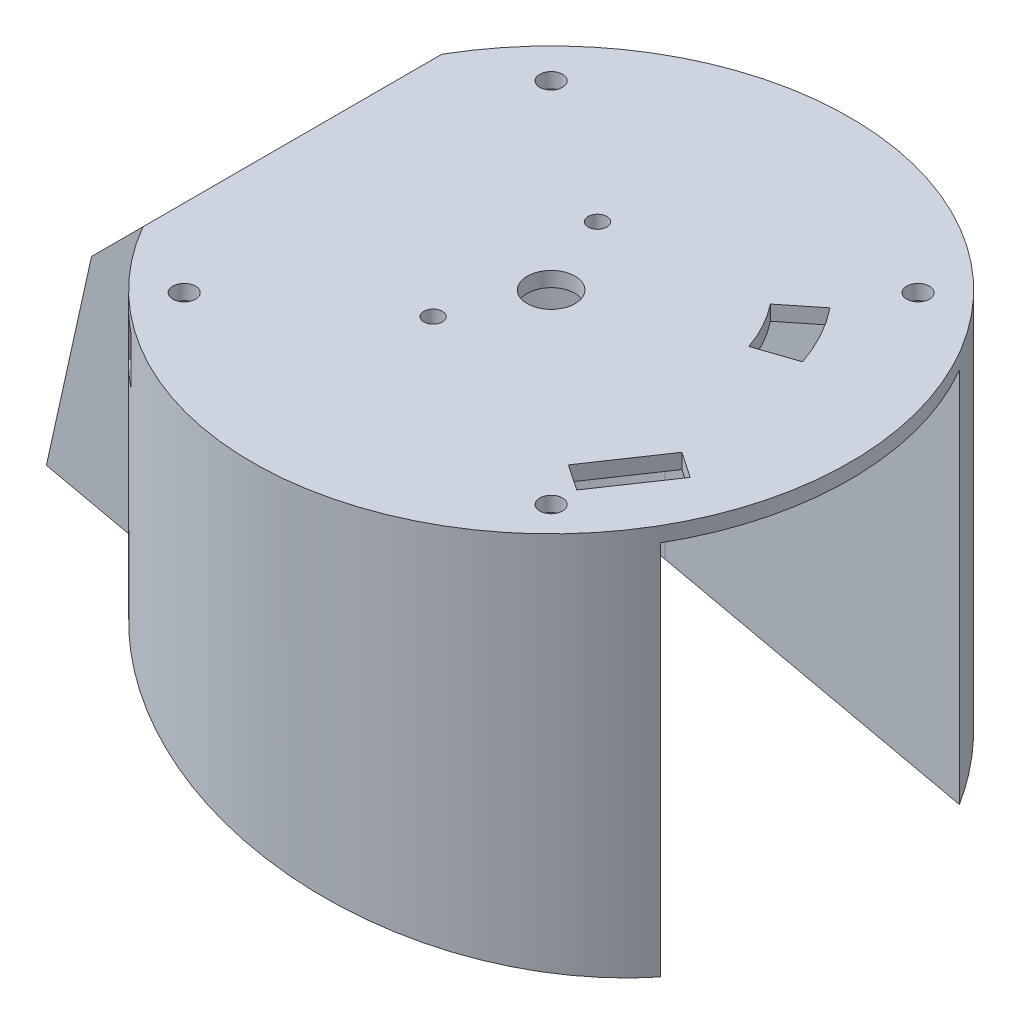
ISO-10303-21;
HEADER;
FILE_DESCRIPTION(('STEP AP214'),'2;1');
FILE_NAME('part.step','',(''),(''),'','','');
FILE_SCHEMA(('AUTOMOTIVE_DESIGN { 1 0 10303 214 1 1 1 1 }'));
ENDSEC;
DATA;
#1=APPLICATION_CONTEXT('core data for automotive mechanical design processes');
#2=APPLICATION_PROTOCOL_DEFINITION('international standard','automotive_design',2000,#1);
#3=PRODUCT_CONTEXT('',#1,'mechanical');
#4=PRODUCT('Part','Part','',(#3));
#5=PRODUCT_RELATED_PRODUCT_CATEGORY('part','',(#4));
#6=PRODUCT_DEFINITION_FORMATION('','',#4);
#7=PRODUCT_DEFINITION_CONTEXT('part definition',#1,'design');
#8=PRODUCT_DEFINITION('design','',#6,#7);
#9=PRODUCT_DEFINITION_SHAPE('','',#8);
#10=(LENGTH_UNIT() NAMED_UNIT(*) SI_UNIT(.MILLI.,.METRE.));
#11=(NAMED_UNIT(*) PLANE_ANGLE_UNIT() SI_UNIT($,.RADIAN.));
#12=(NAMED_UNIT(*) SI_UNIT($,.STERADIAN.) SOLID_ANGLE_UNIT());
#13=UNCERTAINTY_MEASURE_WITH_UNIT(LENGTH_MEASURE(1.E-05),#10,'distance_accuracy_value','');
#14=(GEOMETRIC_REPRESENTATION_CONTEXT(3) GLOBAL_UNCERTAINTY_ASSIGNED_CONTEXT((#13)) GLOBAL_UNIT_ASSIGNED_CONTEXT((#10,
#11,#12)) REPRESENTATION_CONTEXT('',''));
#15=CARTESIAN_POINT('',(0.,0.,0.));
#16=DIRECTION('',(0.,0.,1.));
#17=DIRECTION('',(1.,0.,0.));
#18=AXIS2_PLACEMENT_3D('',#15,#16,#17);
#19=CARTESIAN_POINT('',(-63.5,-53.6327778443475,63.5));
#20=DIRECTION('',(-0.216439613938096,-0.976296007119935,0.));
#21=DIRECTION('',(0.976296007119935,-0.216439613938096,0.));
#22=AXIS2_PLACEMENT_3D('',#19,#20,#21);
#23=PLANE('',#22);
#24=DIRECTION('',(-0.976296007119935,0.216439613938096,0.));
#25=VECTOR('',#24,1.);
#26=CARTESIAN_POINT('',(63.1014620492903,-81.6996462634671,-19.2238682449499));
#27=LINE('',#26,#25);
#28=CARTESIAN_POINT('',(-32.8021887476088,-60.4383187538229,-19.2238682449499));
#29=VERTEX_POINT('',#28);
#30=CARTESIAN_POINT('',(-75.5040021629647,-50.9715546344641,-19.2238682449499));
#31=VERTEX_POINT('',#30);
#32=EDGE_CURVE('E757',#29,#31,#27,.T.);
#33=ORIENTED_EDGE('',*,*,#32,.T.);
#34=DIRECTION('',(0.,0.,-1.));
#35=VECTOR('',#34,1.);
#36=CARTESIAN_POINT('',(-75.5040021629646,-50.9715546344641,-31.75));
#37=LINE('',#36,#35);
#38=CARTESIAN_POINT('',(-75.5040021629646,-50.9715546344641,-31.75));
#39=VERTEX_POINT('',#38);
#40=EDGE_CURVE('E346',#31,#39,#37,.T.);
#41=ORIENTED_EDGE('',*,*,#40,.T.);
#42=DIRECTION('',(0.976296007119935,-0.216439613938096,0.));
#43=VECTOR('',#42,1.);
#44=CARTESIAN_POINT('',(-51.4022986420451,-56.3147736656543,-31.75));
#45=LINE('',#44,#43);
#46=CARTESIAN_POINT('',(-54.9926131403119,-55.518820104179,-31.75));
#47=VERTEX_POINT('',#46);
#48=EDGE_CURVE('E345',#39,#47,#45,.T.);
#49=ORIENTED_EDGE('',*,*,#48,.T.);
#50=CARTESIAN_POINT('',(0.,-67.7103889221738,0.));
#51=DIRECTION('',(-0.216439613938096,-0.976296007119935,0.));
#52=DIRECTION('',(0.976296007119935,-0.216439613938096,0.));
#53=AXIS2_PLACEMENT_3D('',#50,#51,#52);
#54=ELLIPSE('',#53,65.0417491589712,63.5);
#55=CARTESIAN_POINT('',(54.9926131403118,-79.9019577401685,-31.75));
#56=VERTEX_POINT('',#55);
#57=EDGE_CURVE('E567',#47,#56,#54,.T.);
#58=ORIENTED_EDGE('',*,*,#57,.T.);
#59=DIRECTION('',(0.976296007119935,-0.216439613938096,0.));
#60=VECTOR('',#59,1.);
#61=CARTESIAN_POINT('',(2.97472776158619,-68.3698701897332,-31.75));
#62=LINE('',#61,#60);
#63=CARTESIAN_POINT('',(-7.53352456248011,-66.0402467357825,-31.75));
#64=VERTEX_POINT('',#63);
#65=EDGE_CURVE('E673',#64,#56,#62,.T.);
#66=ORIENTED_EDGE('',*,*,#65,.F.);
#67=CARTESIAN_POINT('',(-7.53352456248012,-66.0402467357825,0.));
#68=DIRECTION('',(-0.216439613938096,-0.976296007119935,0.));
#69=DIRECTION('',(-0.976296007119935,0.216439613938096,0.));
#70=AXIS2_PLACEMENT_3D('',#67,#68,#69);
#71=ELLIPSE('',#70,32.5208745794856,31.75);
#72=EDGE_CURVE('E558',#29,#64,#71,.T.);
#73=ORIENTED_EDGE('',*,*,#72,.F.);
#74=EDGE_LOOP('',(#33,#41,#49,#58,#66,#73));
#75=FACE_BOUND('',#74,.T.);
#76=CARTESIAN_POINT('',(39.4969999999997,-76.4666630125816,-38.481));
#77=DIRECTION('',(-0.216439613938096,-0.976296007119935,0.));
#78=DIRECTION('',(0.976296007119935,-0.216439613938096,0.));
#79=AXIS2_PLACEMENT_3D('',#76,#77,#78);
#80=ELLIPSE('',#79,2.4715864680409,2.41299999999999);
#81=CARTESIAN_POINT('',(41.9099999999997,-77.001612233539,-38.481));
#82=VERTEX_POINT('',#81);
#83=EDGE_CURVE('E581',#82,#82,#80,.F.);
#84=ORIENTED_EDGE('',*,*,#83,.T.);
#85=EDGE_LOOP('',(#84));
#86=FACE_BOUND('',#85,.T.);
#87=CARTESIAN_POINT('',(-38.4810000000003,-59.179356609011,-38.4809999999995));
#88=DIRECTION('',(-0.216439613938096,-0.976296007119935,0.));
#89=DIRECTION('',(0.976296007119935,-0.216439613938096,0.));
#90=AXIS2_PLACEMENT_3D('',#87,#88,#89);
#91=ELLIPSE('',#90,2.47158646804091,2.413);
#92=CARTESIAN_POINT('',(-36.0680000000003,-59.7143058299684,-38.4809999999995));
#93=VERTEX_POINT('',#92);
#94=EDGE_CURVE('E572',#93,#93,#91,.F.);
#95=ORIENTED_EDGE('',*,*,#94,.T.);
#96=EDGE_LOOP('',(#95));
#97=FACE_BOUND('',#96,.T.);
#98=ADVANCED_FACE('F39',(#75,#86,#97),#23,.T.);
#99=CARTESIAN_POINT('',(-47.9826820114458,73.1690982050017,-31.75));
#100=DIRECTION('',(-0.976296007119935,0.216439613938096,0.));
#101=DIRECTION('',(-0.216439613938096,-0.976296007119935,0.));
#102=AXIS2_PLACEMENT_3D('',#99,#100,#101);
#103=PLANE('',#102);
#104=DIRECTION('',(-0.216439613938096,-0.976296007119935,0.));
#105=VECTOR('',#104,1.);
#106=CARTESIAN_POINT('',(-75.5040021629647,-50.9715546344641,-19.2238682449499));
#107=LINE('',#106,#105);
#108=CARTESIAN_POINT('',(-65.9237272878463,-7.75772728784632,-19.2238682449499));
#109=VERTEX_POINT('',#108);
#110=EDGE_CURVE('E327',#109,#31,#107,.T.);
#111=ORIENTED_EDGE('',*,*,#110,.F.);
#112=DIRECTION('',(0.,0.,-1.));
#113=VECTOR('',#112,1.);
#114=CARTESIAN_POINT('',(-65.9237272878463,-7.75772728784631,-31.75));
#115=LINE('',#114,#113);
#116=CARTESIAN_POINT('',(-65.9237272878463,-7.75772728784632,-31.75));
#117=VERTEX_POINT('',#116);
#118=EDGE_CURVE('E690',#109,#117,#115,.T.);
#119=ORIENTED_EDGE('',*,*,#118,.T.);
#120=DIRECTION('',(-0.216439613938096,-0.976296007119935,0.));
#121=VECTOR('',#120,1.);
#122=CARTESIAN_POINT('',(-47.9826820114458,73.1690982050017,-31.75));
#123=LINE('',#122,#121);
#124=EDGE_CURVE('E355',#117,#39,#123,.T.);
#125=ORIENTED_EDGE('',*,*,#124,.T.);
#126=ORIENTED_EDGE('',*,*,#40,.F.);
#127=EDGE_LOOP('',(#111,#119,#125,#126));
#128=FACE_BOUND('',#127,.T.);
#129=ADVANCED_FACE('F752',(#128),#103,.T.);
#130=CARTESIAN_POINT('',(39.4969999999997,3.176,-38.481));
#131=DIRECTION('',(0.,-1.,0.));
#132=DIRECTION('',(0.,0.,-1.));
#133=AXIS2_PLACEMENT_3D('',#130,#131,#132);
#134=CYLINDRICAL_SURFACE('',#133,2.41299999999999);
#135=CARTESIAN_POINT('',(39.4969999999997,3.175,-38.481));
#136=DIRECTION('',(0.,1.,0.));
#137=DIRECTION('',(0.,0.,1.));
#138=AXIS2_PLACEMENT_3D('',#135,#136,#137);
#139=CIRCLE('',#138,2.41299999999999);
#140=CARTESIAN_POINT('',(39.4969999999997,3.175,-36.068));
#141=VERTEX_POINT('',#140);
#142=EDGE_CURVE('E643',#141,#141,#139,.F.);
#143=ORIENTED_EDGE('',*,*,#142,.F.);
#144=EDGE_LOOP('',(#143));
#145=FACE_BOUND('',#144,.T.);
#146=CARTESIAN_POINT('',(39.4969999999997,0.,-38.481));
#147=DIRECTION('',(0.,-1.,0.));
#148=DIRECTION('',(0.,0.,-1.));
#149=AXIS2_PLACEMENT_3D('',#146,#147,#148);
#150=CIRCLE('',#149,2.41299999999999);
#151=CARTESIAN_POINT('',(39.4969999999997,0.,-40.894));
#152=VERTEX_POINT('',#151);
#153=EDGE_CURVE('E414',#152,#152,#150,.F.);
#154=ORIENTED_EDGE('',*,*,#153,.F.);
#155=EDGE_LOOP('',(#154));
#156=FACE_BOUND('',#155,.T.);
#157=ADVANCED_FACE('F814',(#145,#156),#134,.F.);
#158=CARTESIAN_POINT('',(-38.481,3.176,39.4970000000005));
#159=DIRECTION('',(0.,-1.,0.));
#160=DIRECTION('',(0.,0.,-1.));
#161=AXIS2_PLACEMENT_3D('',#158,#159,#160);
#162=CYLINDRICAL_SURFACE('',#161,2.413);
#163=CARTESIAN_POINT('',(-38.481,3.175,39.4970000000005));
#164=DIRECTION('',(0.,1.,0.));
#165=DIRECTION('',(0.,0.,1.));
#166=AXIS2_PLACEMENT_3D('',#163,#164,#165);
#167=CIRCLE('',#166,2.413);
#168=CARTESIAN_POINT('',(-38.481,3.175,41.9100000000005));
#169=VERTEX_POINT('',#168);
#170=EDGE_CURVE('E644',#169,#169,#167,.F.);
#171=ORIENTED_EDGE('',*,*,#170,.F.);
#172=EDGE_LOOP('',(#171));
#173=FACE_BOUND('',#172,.T.);
#174=CARTESIAN_POINT('',(-38.481,0.,39.4970000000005));
#175=DIRECTION('',(0.,-1.,0.));
#176=DIRECTION('',(0.,0.,-1.));
#177=AXIS2_PLACEMENT_3D('',#174,#175,#176);
#178=CIRCLE('',#177,2.413);
#179=CARTESIAN_POINT('',(-38.481,0.,37.0840000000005));
#180=VERTEX_POINT('',#179);
#181=EDGE_CURVE('E696',#180,#180,#178,.F.);
#182=ORIENTED_EDGE('',*,*,#181,.F.);
#183=EDGE_LOOP('',(#182));
#184=FACE_BOUND('',#183,.T.);
#185=ADVANCED_FACE('F853',(#173,#184),#162,.F.);
#186=CARTESIAN_POINT('',(-38.4810000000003,3.176,-38.4809999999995));
#187=DIRECTION('',(0.,-1.,0.));
#188=DIRECTION('',(0.,0.,-1.));
#189=AXIS2_PLACEMENT_3D('',#186,#187,#188);
#190=CYLINDRICAL_SURFACE('',#189,2.413);
#191=CARTESIAN_POINT('',(-38.4810000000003,3.175,-38.4809999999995));
#192=DIRECTION('',(0.,1.,0.));
#193=DIRECTION('',(0.,0.,1.));
#194=AXIS2_PLACEMENT_3D('',#191,#192,#193);
#195=CIRCLE('',#194,2.413);
#196=CARTESIAN_POINT('',(-38.4810000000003,3.175,-36.0679999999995));
#197=VERTEX_POINT('',#196);
#198=EDGE_CURVE('E640',#197,#197,#195,.F.);
#199=ORIENTED_EDGE('',*,*,#198,.F.);
#200=EDGE_LOOP('',(#199));
#201=FACE_BOUND('',#200,.T.);
#202=CARTESIAN_POINT('',(-38.4810000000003,0.,-38.4809999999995));
#203=DIRECTION('',(0.,-1.,0.));
#204=DIRECTION('',(0.,0.,-1.));
#205=AXIS2_PLACEMENT_3D('',#202,#203,#204);
#206=CIRCLE('',#205,2.413);
#207=CARTESIAN_POINT('',(-38.4810000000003,0.,-40.8939999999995));
#208=VERTEX_POINT('',#207);
#209=EDGE_CURVE('E493',#208,#208,#206,.F.);
#210=ORIENTED_EDGE('',*,*,#209,.F.);
#211=EDGE_LOOP('',(#210));
#212=FACE_BOUND('',#211,.T.);
#213=ADVANCED_FACE('F848',(#201,#212),#190,.F.);
#214=CARTESIAN_POINT('',(39.497,3.176,39.497));
#215=DIRECTION('',(0.,-1.,0.));
#216=DIRECTION('',(0.,0.,-1.));
#217=AXIS2_PLACEMENT_3D('',#214,#215,#216);
#218=CYLINDRICAL_SURFACE('',#217,2.413);
#219=CARTESIAN_POINT('',(39.497,3.175,39.497));
#220=DIRECTION('',(0.,1.,0.));
#221=DIRECTION('',(0.,0.,1.));
#222=AXIS2_PLACEMENT_3D('',#219,#220,#221);
#223=CIRCLE('',#222,2.413);
#224=CARTESIAN_POINT('',(39.497,3.175,41.91));
#225=VERTEX_POINT('',#224);
#226=EDGE_CURVE('E639',#225,#225,#223,.F.);
#227=ORIENTED_EDGE('',*,*,#226,.F.);
#228=EDGE_LOOP('',(#227));
#229=FACE_BOUND('',#228,.T.);
#230=CARTESIAN_POINT('',(39.497,0.,39.497));
#231=DIRECTION('',(0.,-1.,0.));
#232=DIRECTION('',(0.,0.,-1.));
#233=AXIS2_PLACEMENT_3D('',#230,#231,#232);
#234=CIRCLE('',#233,2.413);
#235=CARTESIAN_POINT('',(39.497,0.,37.084));
#236=VERTEX_POINT('',#235);
#237=EDGE_CURVE('E538',#236,#236,#234,.F.);
#238=ORIENTED_EDGE('',*,*,#237,.F.);
#239=EDGE_LOOP('',(#238));
#240=FACE_BOUND('',#239,.T.);
#241=ADVANCED_FACE('F858',(#229,#240),#218,.F.);
#242=CARTESIAN_POINT('',(0.,-81.788,31.75));
#243=DIRECTION('',(0.,0.,1.));
#244=DIRECTION('',(1.,0.,0.));
#245=AXIS2_PLACEMENT_3D('',#242,#243,#244);
#246=PLANE('',#245);
#247=DIRECTION('',(0.,1.,0.));
#248=VECTOR('',#247,1.);
#249=CARTESIAN_POINT('',(43.7497620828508,-10.16,31.75));
#250=LINE('',#249,#248);
#251=CARTESIAN_POINT('',(43.7497620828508,-10.16,31.75));
#252=VERTEX_POINT('',#251);
#253=CARTESIAN_POINT('',(43.7497620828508,0.,31.75));
#254=VERTEX_POINT('',#253);
#255=EDGE_CURVE('E509',#252,#254,#250,.T.);
#256=ORIENTED_EDGE('',*,*,#255,.T.);
#257=DIRECTION('',(1.,0.,0.));
#258=VECTOR('',#257,1.);
#259=CARTESIAN_POINT('',(0.,0.,31.75));
#260=LINE('',#259,#258);
#261=CARTESIAN_POINT('',(54.9926131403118,0.,31.75));
#262=VERTEX_POINT('',#261);
#263=EDGE_CURVE('E588',#254,#262,#260,.T.);
#264=ORIENTED_EDGE('',*,*,#263,.T.);
#265=DIRECTION('',(0.,1.,0.));
#266=VECTOR('',#265,1.);
#267=CARTESIAN_POINT('',(54.9926131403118,-81.788,31.75));
#268=LINE('',#267,#266);
#269=CARTESIAN_POINT('',(54.9926131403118,-79.9019577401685,31.75));
#270=VERTEX_POINT('',#269);
#271=EDGE_CURVE('E602',#270,#262,#268,.T.);
#272=ORIENTED_EDGE('',*,*,#271,.F.);
#273=DIRECTION('',(0.976296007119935,-0.216439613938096,0.));
#274=VECTOR('',#273,1.);
#275=CARTESIAN_POINT('',(2.97472776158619,-68.3698701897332,31.75));
#276=LINE('',#275,#274);
#277=CARTESIAN_POINT('',(-7.53352456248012,-66.0402467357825,31.75));
#278=VERTEX_POINT('',#277);
#279=EDGE_CURVE('E570',#278,#270,#276,.T.);
#280=ORIENTED_EDGE('',*,*,#279,.F.);
#281=DIRECTION('',(0.,1.,0.));
#282=VECTOR('',#281,1.);
#283=CARTESIAN_POINT('',(-7.53352456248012,-81.788,31.75));
#284=LINE('',#283,#282);
#285=CARTESIAN_POINT('',(-7.53352456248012,0.,31.75));
#286=VERTEX_POINT('',#285);
#287=EDGE_CURVE('E605',#278,#286,#284,.T.);
#288=ORIENTED_EDGE('',*,*,#287,.T.);
#289=CARTESIAN_POINT('',(35.2442379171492,0.,31.75));
#290=VERTEX_POINT('',#289);
#291=EDGE_CURVE('E589',#286,#290,#260,.T.);
#292=ORIENTED_EDGE('',*,*,#291,.T.);
#293=DIRECTION('',(0.,1.,0.));
#294=VECTOR('',#293,1.);
#295=CARTESIAN_POINT('',(35.2442379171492,-10.16,31.75));
#296=LINE('',#295,#294);
#297=CARTESIAN_POINT('',(35.2442379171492,-10.16,31.75));
#298=VERTEX_POINT('',#297);
#299=EDGE_CURVE('E524',#298,#290,#296,.T.);
#300=ORIENTED_EDGE('',*,*,#299,.F.);
#301=DIRECTION('',(-1.,0.,0.));
#302=VECTOR('',#301,1.);
#303=CARTESIAN_POINT('',(0.,-10.16,31.75));
#304=LINE('',#303,#302);
#305=EDGE_CURVE('E506',#252,#298,#304,.T.);
#306=ORIENTED_EDGE('',*,*,#305,.F.);
#307=EDGE_LOOP('',(#256,#264,#272,#280,#288,#292,#300,#306));
#308=FACE_BOUND('',#307,.T.);
#309=ADVANCED_FACE('F722',(#308),#246,.F.);
#310=CARTESIAN_POINT('',(39.5421483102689,-9.525,34.1012329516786));
#311=DIRECTION('',(0.828015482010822,0.,0.560705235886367));
#312=DIRECTION('',(0.560705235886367,0.,-0.828015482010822));
#313=AXIS2_PLACEMENT_3D('',#310,#311,#312);
#314=PLANE('',#313);
#315=DIRECTION('',(0.560705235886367,0.,-0.828015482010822));
#316=VECTOR('',#315,1.);
#317=CARTESIAN_POINT('',(42.9427466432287,0.,29.0794356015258));
#318=LINE('',#317,#316);
#319=CARTESIAN_POINT('',(39.5421483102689,0.,34.1012329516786));
#320=VERTEX_POINT('',#319);
#321=CARTESIAN_POINT('',(49.2803535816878,0.,19.7204420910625));
#322=VERTEX_POINT('',#321);
#323=EDGE_CURVE('E687',#320,#322,#318,.T.);
#324=ORIENTED_EDGE('',*,*,#323,.F.);
#325=DIRECTION('',(0.,1.,0.));
#326=VECTOR('',#325,1.);
#327=CARTESIAN_POINT('',(39.5421483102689,-9.525,34.1012329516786));
#328=LINE('',#327,#326);
#329=CARTESIAN_POINT('',(39.5421483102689,3.175,34.1012329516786));
#330=VERTEX_POINT('',#329);
#331=EDGE_CURVE('E561',#320,#330,#328,.T.);
#332=ORIENTED_EDGE('',*,*,#331,.T.);
#333=DIRECTION('',(0.560705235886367,0.,-0.828015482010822));
#334=VECTOR('',#333,1.);
#335=CARTESIAN_POINT('',(39.5421483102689,3.175,34.1012329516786));
#336=LINE('',#335,#334);
#337=CARTESIAN_POINT('',(49.2803535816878,3.175,19.7204420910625));
#338=VERTEX_POINT('',#337);
#339=EDGE_CURVE('E549',#330,#338,#336,.T.);
#340=ORIENTED_EDGE('',*,*,#339,.T.);
#341=DIRECTION('',(0.,1.,0.));
#342=VECTOR('',#341,1.);
#343=CARTESIAN_POINT('',(49.2803535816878,-9.525,19.7204420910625));
#344=LINE('',#343,#342);
#345=EDGE_CURVE('E559',#322,#338,#344,.T.);
#346=ORIENTED_EDGE('',*,*,#345,.F.);
#347=EDGE_LOOP('',(#324,#332,#340,#346));
#348=FACE_BOUND('',#347,.T.);
#349=ADVANCED_FACE('F882',(#348),#314,.F.);
#350=CARTESIAN_POINT('',(34.0354875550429,-9.525,30.3723008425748));
#351=DIRECTION('',(-0.560705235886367,0.,0.828015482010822));
#352=DIRECTION('',(0.828015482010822,0.,0.560705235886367));
#353=AXIS2_PLACEMENT_3D('',#350,#351,#352);
#354=PLANE('',#353);
#355=ORIENTED_EDGE('',*,*,#331,.F.);
#356=DIRECTION('',(0.828015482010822,0.,0.560705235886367));
#357=VECTOR('',#356,1.);
#358=CARTESIAN_POINT('',(-3.40059833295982,0.,5.0217973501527));
#359=LINE('',#358,#357);
#360=CARTESIAN_POINT('',(34.0354875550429,0.,30.3723008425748));
#361=VERTEX_POINT('',#360);
#362=EDGE_CURVE('E678',#361,#320,#359,.T.);
#363=ORIENTED_EDGE('',*,*,#362,.F.);
#364=DIRECTION('',(0.,1.,0.));
#365=VECTOR('',#364,1.);
#366=CARTESIAN_POINT('',(34.0354875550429,-9.525,30.3723008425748));
#367=LINE('',#366,#365);
#368=CARTESIAN_POINT('',(34.0354875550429,3.175,30.3723008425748));
#369=VERTEX_POINT('',#368);
#370=EDGE_CURVE('E555',#361,#369,#367,.T.);
#371=ORIENTED_EDGE('',*,*,#370,.T.);
#372=DIRECTION('',(0.828015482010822,0.,0.560705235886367));
#373=VECTOR('',#372,1.);
#374=CARTESIAN_POINT('',(34.0354875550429,3.175,30.3723008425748));
#375=LINE('',#374,#373);
#376=EDGE_CURVE('E546',#369,#330,#375,.T.);
#377=ORIENTED_EDGE('',*,*,#376,.T.);
#378=EDGE_LOOP('',(#355,#363,#371,#377));
#379=FACE_BOUND('',#378,.T.);
#380=ADVANCED_FACE('F877',(#379),#354,.F.);
#381=CARTESIAN_POINT('',(0.,3.175,0.));
#382=DIRECTION('',(0.,-1.,0.));
#383=DIRECTION('',(0.,0.,-1.));
#384=AXIS2_PLACEMENT_3D('',#381,#382,#383);
#385=CYLINDRICAL_SURFACE('',#384,63.5);
#386=DIRECTION('',(0.,1.,0.));
#387=VECTOR('',#386,1.);
#388=CARTESIAN_POINT('',(-45.8693057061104,-10.16,-43.9119208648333));
#389=LINE('',#388,#387);
#390=CARTESIAN_POINT('',(-45.8693057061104,-10.16,-43.9119208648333));
#391=VERTEX_POINT('',#390);
#392=CARTESIAN_POINT('',(-45.8693057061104,0.,-43.9119208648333));
#393=VERTEX_POINT('',#392);
#394=EDGE_CURVE('E427',#391,#393,#389,.T.);
#395=ORIENTED_EDGE('',*,*,#394,.F.);
#396=CARTESIAN_POINT('',(0.,-10.16,0.));
#397=DIRECTION('',(0.,-1.,0.));
#398=DIRECTION('',(0.,0.,-1.));
#399=AXIS2_PLACEMENT_3D('',#396,#397,#398);
#400=CIRCLE('',#399,63.5);
#401=CARTESIAN_POINT('',(-40.329527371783,-10.16,-49.0487433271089));
#402=VERTEX_POINT('',#401);
#403=EDGE_CURVE('E415',#402,#391,#400,.F.);
#404=ORIENTED_EDGE('',*,*,#403,.F.);
#405=DIRECTION('',(0.,1.,0.));
#406=VECTOR('',#405,1.);
#407=CARTESIAN_POINT('',(-40.329527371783,-10.16,-49.0487433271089));
#408=LINE('',#407,#406);
#409=CARTESIAN_POINT('',(-40.329527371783,0.,-49.0487433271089));
#410=VERTEX_POINT('',#409);
#411=EDGE_CURVE('E390',#402,#410,#408,.T.);
#412=ORIENTED_EDGE('',*,*,#411,.T.);
#413=CARTESIAN_POINT('',(0.,0.,0.));
#414=DIRECTION('',(0.,-1.,0.));
#415=DIRECTION('',(0.,0.,-1.));
#416=AXIS2_PLACEMENT_3D('',#413,#414,#415);
#417=CIRCLE('',#416,63.5);
#418=EDGE_CURVE('E428',#410,#393,#417,.F.);
#419=ORIENTED_EDGE('',*,*,#418,.T.);
#420=EDGE_LOOP('',(#395,#404,#412,#419));
#421=FACE_BOUND('',#420,.T.);
#422=DIRECTION('',(0.,1.,0.));
#423=VECTOR('',#422,1.);
#424=CARTESIAN_POINT('',(-39.9307074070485,-10.16,49.3739668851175));
#425=LINE('',#424,#423);
#426=CARTESIAN_POINT('',(-39.9307074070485,-10.16,49.3739668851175));
#427=VERTEX_POINT('',#426);
#428=CARTESIAN_POINT('',(-39.9307074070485,0.,49.3739668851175));
#429=VERTEX_POINT('',#428);
#430=EDGE_CURVE('E481',#427,#429,#425,.T.);
#431=ORIENTED_EDGE('',*,*,#430,.F.);
#432=CARTESIAN_POINT('',(0.,-10.16,0.));
#433=DIRECTION('',(0.,-1.,0.));
#434=DIRECTION('',(0.,0.,-1.));
#435=AXIS2_PLACEMENT_3D('',#432,#433,#434);
#436=CIRCLE('',#435,63.5);
#437=CARTESIAN_POINT('',(-45.5022485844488,-10.16,44.2921592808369));
#438=VERTEX_POINT('',#437);
#439=EDGE_CURVE('E460',#427,#438,#436,.T.);
#440=ORIENTED_EDGE('',*,*,#439,.T.);
#441=DIRECTION('',(0.,1.,0.));
#442=VECTOR('',#441,1.);
#443=CARTESIAN_POINT('',(-45.5022485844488,-10.16,44.2921592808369));
#444=LINE('',#443,#442);
#445=CARTESIAN_POINT('',(-45.5022485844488,0.,44.2921592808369));
#446=VERTEX_POINT('',#445);
#447=EDGE_CURVE('E478',#438,#446,#444,.T.);
#448=ORIENTED_EDGE('',*,*,#447,.T.);
#449=CARTESIAN_POINT('',(0.,0.,0.));
#450=DIRECTION('',(0.,-1.,0.));
#451=DIRECTION('',(0.,0.,-1.));
#452=AXIS2_PLACEMENT_3D('',#449,#450,#451);
#453=CIRCLE('',#452,63.5);
#454=EDGE_CURVE('E473',#429,#446,#453,.T.);
#455=ORIENTED_EDGE('',*,*,#454,.F.);
#456=EDGE_LOOP('',(#431,#440,#448,#455));
#457=FACE_BOUND('',#456,.T.);
#458=DIRECTION('',(0.,-1.,0.));
#459=VECTOR('',#458,1.);
#460=CARTESIAN_POINT('',(-54.9926131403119,3.175,-31.75));
#461=LINE('',#460,#459);
#462=CARTESIAN_POINT('',(-54.9926131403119,3.17338685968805,-31.75));
#463=VERTEX_POINT('',#462);
#464=EDGE_CURVE('E364',#47,#463,#461,.F.);
#465=ORIENTED_EDGE('',*,*,#464,.T.);
#466=CARTESIAN_POINT('',(0.,58.1659999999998,0.));
#467=DIRECTION('',(0.707106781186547,-0.707106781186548,0.));
#468=DIRECTION('',(-0.707106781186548,-0.707106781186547,0.));
#469=AXIS2_PLACEMENT_3D('',#466,#467,#468);
#470=ELLIPSE('',#469,89.8025612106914,63.5);
#471=CARTESIAN_POINT('',(-54.9909999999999,3.175,-31.752793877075));
#472=VERTEX_POINT('',#471);
#473=EDGE_CURVE('E705',#463,#472,#470,.T.);
#474=ORIENTED_EDGE('',*,*,#473,.T.);
#475=CARTESIAN_POINT('',(0.,3.175,0.));
#476=DIRECTION('',(0.,1.,0.));
#477=DIRECTION('',(0.,0.,1.));
#478=AXIS2_PLACEMENT_3D('',#475,#476,#477);
#479=CIRCLE('',#478,63.5);
#480=CARTESIAN_POINT('',(-54.9909999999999,3.175,31.752793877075));
#481=VERTEX_POINT('',#480);
#482=EDGE_CURVE('E670',#481,#472,#479,.T.);
#483=ORIENTED_EDGE('',*,*,#482,.F.);
#484=CARTESIAN_POINT('',(0.,58.1659999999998,0.));
#485=DIRECTION('',(0.707106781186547,-0.707106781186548,0.));
#486=DIRECTION('',(-0.707106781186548,-0.707106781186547,0.));
#487=AXIS2_PLACEMENT_3D('',#484,#485,#486);
#488=ELLIPSE('',#487,89.8025612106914,63.5);
#489=CARTESIAN_POINT('',(-54.9926131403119,3.17338685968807,31.75));
#490=VERTEX_POINT('',#489);
#491=EDGE_CURVE('E62',#481,#490,#488,.T.);
#492=ORIENTED_EDGE('',*,*,#491,.T.);
#493=DIRECTION('',(0.,-1.,0.));
#494=VECTOR('',#493,1.);
#495=CARTESIAN_POINT('',(-54.9926131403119,3.175,31.75));
#496=LINE('',#495,#494);
#497=CARTESIAN_POINT('',(-54.9926131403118,-55.518820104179,31.75));
#498=VERTEX_POINT('',#497);
#499=EDGE_CURVE('E367',#490,#498,#496,.T.);
#500=ORIENTED_EDGE('',*,*,#499,.T.);
#501=EDGE_CURVE('E568',#270,#498,#54,.T.);
#502=ORIENTED_EDGE('',*,*,#501,.F.);
#503=ORIENTED_EDGE('',*,*,#271,.T.);
#504=CARTESIAN_POINT('',(0.,0.,0.));
#505=DIRECTION('',(0.,1.,0.));
#506=DIRECTION('',(0.,0.,1.));
#507=AXIS2_PLACEMENT_3D('',#504,#505,#506);
#508=CIRCLE('',#507,63.5);
#509=CARTESIAN_POINT('',(54.9926131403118,0.,-31.75));
#510=VERTEX_POINT('',#509);
#511=EDGE_CURVE('E667',#262,#510,#508,.T.);
#512=ORIENTED_EDGE('',*,*,#511,.T.);
#513=DIRECTION('',(0.,1.,0.));
#514=VECTOR('',#513,1.);
#515=CARTESIAN_POINT('',(54.9926131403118,-81.788,-31.75));
#516=LINE('',#515,#514);
#517=EDGE_CURVE('E599',#56,#510,#516,.T.);
#518=ORIENTED_EDGE('',*,*,#517,.F.);
#519=ORIENTED_EDGE('',*,*,#57,.F.);
#520=EDGE_LOOP('',(#465,#474,#483,#492,#500,#502,#503,#512,#518,#519));
#521=FACE_BOUND('',#520,.T.);
#522=ADVANCED_FACE('F712',(#421,#457,#521),#385,.T.);
#523=CARTESIAN_POINT('',(39.4969999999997,-10.16,-38.481));
#524=DIRECTION('',(0.,-1.,0.));
#525=DIRECTION('',(0.,0.,-1.));
#526=AXIS2_PLACEMENT_3D('',#523,#524,#525);
#527=CIRCLE('',#526,2.41299999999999);
#528=CARTESIAN_POINT('',(39.4969999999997,-10.16,-40.894));
#529=VERTEX_POINT('',#528);
#530=EDGE_CURVE('E490',#529,#529,#527,.F.);
#531=ORIENTED_EDGE('',*,*,#530,.T.);
#532=EDGE_LOOP('',(#531));
#533=FACE_BOUND('',#532,.T.);
#534=ORIENTED_EDGE('',*,*,#83,.F.);
#535=EDGE_LOOP('',(#534));
#536=FACE_BOUND('',#535,.T.);
#537=ADVANCED_FACE('F856',(#533,#536),#134,.F.);
#538=CARTESIAN_POINT('',(39.497,-10.16,39.497));
#539=DIRECTION('',(0.,-1.,0.));
#540=DIRECTION('',(0.,0.,-1.));
#541=AXIS2_PLACEMENT_3D('',#538,#539,#540);
#542=CIRCLE('',#541,2.413);
#543=CARTESIAN_POINT('',(39.497,-10.16,37.084));
#544=VERTEX_POINT('',#543);
#545=EDGE_CURVE('E541',#544,#544,#542,.F.);
#546=ORIENTED_EDGE('',*,*,#545,.T.);
#547=EDGE_LOOP('',(#546));
#548=FACE_BOUND('',#547,.T.);
#549=CARTESIAN_POINT('',(39.497,-76.4666630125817,39.497));
#550=DIRECTION('',(-0.216439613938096,-0.976296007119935,0.));
#551=DIRECTION('',(0.976296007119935,-0.216439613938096,0.));
#552=AXIS2_PLACEMENT_3D('',#549,#550,#551);
#553=ELLIPSE('',#552,2.47158646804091,2.413);
#554=CARTESIAN_POINT('',(41.91,-77.0016122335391,39.497));
#555=VERTEX_POINT('',#554);
#556=EDGE_CURVE('E578',#555,#555,#553,.F.);
#557=ORIENTED_EDGE('',*,*,#556,.F.);
#558=EDGE_LOOP('',(#557));
#559=FACE_BOUND('',#558,.T.);
#560=ADVANCED_FACE('F851',(#548,#559),#218,.F.);
#561=CARTESIAN_POINT('',(-38.481,-10.16,39.4970000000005));
#562=DIRECTION('',(0.,-1.,0.));
#563=DIRECTION('',(0.,0.,-1.));
#564=AXIS2_PLACEMENT_3D('',#561,#562,#563);
#565=CIRCLE('',#564,2.413);
#566=CARTESIAN_POINT('',(-38.481,-10.16,37.0840000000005));
#567=VERTEX_POINT('',#566);
#568=EDGE_CURVE('E514',#567,#567,#565,.F.);
#569=ORIENTED_EDGE('',*,*,#568,.T.);
#570=EDGE_LOOP('',(#569));
#571=FACE_BOUND('',#570,.T.);
#572=CARTESIAN_POINT('',(-38.481,-59.1793566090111,39.4970000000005));
#573=DIRECTION('',(-0.216439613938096,-0.976296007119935,0.));
#574=DIRECTION('',(0.976296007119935,-0.216439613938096,0.));
#575=AXIS2_PLACEMENT_3D('',#572,#573,#574);
#576=ELLIPSE('',#575,2.47158646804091,2.413);
#577=CARTESIAN_POINT('',(-36.068,-59.7143058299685,39.4970000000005));
#578=VERTEX_POINT('',#577);
#579=EDGE_CURVE('E575',#578,#578,#576,.F.);
#580=ORIENTED_EDGE('',*,*,#579,.F.);
#581=EDGE_LOOP('',(#580));
#582=FACE_BOUND('',#581,.T.);
#583=ADVANCED_FACE('F846',(#571,#582),#162,.F.);
#584=CARTESIAN_POINT('',(-38.4810000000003,-10.16,-38.4809999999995));
#585=DIRECTION('',(0.,-1.,0.));
#586=DIRECTION('',(0.,0.,-1.));
#587=AXIS2_PLACEMENT_3D('',#584,#585,#586);
#588=CIRCLE('',#587,2.413);
#589=CARTESIAN_POINT('',(-38.4810000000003,-10.16,-40.8939999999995));
#590=VERTEX_POINT('',#589);
#591=EDGE_CURVE('E693',#590,#590,#588,.F.);
#592=ORIENTED_EDGE('',*,*,#591,.T.);
#593=EDGE_LOOP('',(#592));
#594=FACE_BOUND('',#593,.T.);
#595=ORIENTED_EDGE('',*,*,#94,.F.);
#596=EDGE_LOOP('',(#595));
#597=FACE_BOUND('',#596,.T.);
#598=ADVANCED_FACE('F843',(#594,#597),#190,.F.);
#599=CARTESIAN_POINT('',(-7.53352456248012,-81.788,0.));
#600=DIRECTION('',(0.,1.,0.));
#601=DIRECTION('',(0.,0.,1.));
#602=AXIS2_PLACEMENT_3D('',#599,#600,#601);
#603=CYLINDRICAL_SURFACE('',#602,31.75);
#604=DIRECTION('',(0.,1.,0.));
#605=VECTOR('',#604,1.);
#606=CARTESIAN_POINT('',(-32.8021887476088,-81.788,-19.2238682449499));
#607=LINE('',#606,#605);
#608=CARTESIAN_POINT('',(-32.8021887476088,-15.1005956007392,-19.2238682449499));
#609=VERTEX_POINT('',#608);
#610=EDGE_CURVE('E354',#29,#609,#607,.T.);
#611=ORIENTED_EDGE('',*,*,#610,.F.);
#612=ORIENTED_EDGE('',*,*,#72,.T.);
#613=DIRECTION('',(0.,1.,0.));
#614=VECTOR('',#613,1.);
#615=CARTESIAN_POINT('',(-7.53352456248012,-81.788,-31.75));
#616=LINE('',#615,#614);
#617=CARTESIAN_POINT('',(-7.53352456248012,0.,-31.75));
#618=VERTEX_POINT('',#617);
#619=EDGE_CURVE('E596',#64,#618,#616,.T.);
#620=ORIENTED_EDGE('',*,*,#619,.T.);
#621=CARTESIAN_POINT('',(-7.53352456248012,0.,0.));
#622=DIRECTION('',(0.,-1.,0.));
#623=DIRECTION('',(0.,0.,-1.));
#624=AXIS2_PLACEMENT_3D('',#621,#622,#623);
#625=CIRCLE('',#624,31.75);
#626=CARTESIAN_POINT('',(-38.9176138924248,0.,-4.80639541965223));
#627=VERTEX_POINT('',#626);
#628=EDGE_CURVE('E584',#627,#618,#625,.T.);
#629=ORIENTED_EDGE('',*,*,#628,.F.);
#630=CARTESIAN_POINT('',(-7.53352456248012,141.564478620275,0.));
#631=DIRECTION('',(0.976296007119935,-0.216439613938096,0.));
#632=DIRECTION('',(0.216439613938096,0.976296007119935,0.));
#633=AXIS2_PLACEMENT_3D('',#630,#631,#632);
#634=ELLIPSE('',#633,146.692185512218,31.75);
#635=CARTESIAN_POINT('',(-38.9176138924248,0.,4.80639541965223));
#636=VERTEX_POINT('',#635);
#637=EDGE_CURVE('E362',#636,#627,#634,.T.);
#638=ORIENTED_EDGE('',*,*,#637,.F.);
#639=EDGE_CURVE('E585',#286,#636,#625,.T.);
#640=ORIENTED_EDGE('',*,*,#639,.F.);
#641=ORIENTED_EDGE('',*,*,#287,.F.);
#642=CARTESIAN_POINT('',(-32.8021887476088,-60.4383187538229,19.2238682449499));
#643=VERTEX_POINT('',#642);
#644=EDGE_CURVE('E565',#278,#643,#71,.T.);
#645=ORIENTED_EDGE('',*,*,#644,.T.);
#646=DIRECTION('',(0.,1.,0.));
#647=VECTOR('',#646,1.);
#648=CARTESIAN_POINT('',(-32.8021887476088,-81.788,19.2238682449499));
#649=LINE('',#648,#647);
#650=CARTESIAN_POINT('',(-32.8021887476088,-15.1005956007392,19.2238682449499));
#651=VERTEX_POINT('',#650);
#652=EDGE_CURVE('E322',#651,#643,#649,.F.);
#653=ORIENTED_EDGE('',*,*,#652,.F.);
#654=CARTESIAN_POINT('',(-7.53352456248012,-20.7025235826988,0.));
#655=DIRECTION('',(0.216439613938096,0.976296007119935,0.));
#656=DIRECTION('',(-0.976296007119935,0.216439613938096,0.));
#657=AXIS2_PLACEMENT_3D('',#654,#655,#656);
#658=ELLIPSE('',#657,32.5208745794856,31.75);
#659=EDGE_CURVE('E759',#609,#651,#658,.T.);
#660=ORIENTED_EDGE('',*,*,#659,.F.);
#661=EDGE_LOOP('',(#611,#612,#620,#629,#638,#640,#641,#645,#653,#660));
#662=FACE_BOUND('',#661,.T.);
#663=ADVANCED_FACE('F771',(#662),#603,.F.);
#664=CARTESIAN_POINT('',(0.,-81.788,-31.75));
#665=DIRECTION('',(0.,0.,1.));
#666=DIRECTION('',(1.,0.,0.));
#667=AXIS2_PLACEMENT_3D('',#664,#665,#666);
#668=PLANE('',#667);
#669=DIRECTION('',(0.,1.,0.));
#670=VECTOR('',#669,1.);
#671=CARTESIAN_POINT('',(35.2442379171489,-10.16,-31.75));
#672=LINE('',#671,#670);
#673=CARTESIAN_POINT('',(35.2442379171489,-10.16,-31.75));
#674=VERTEX_POINT('',#673);
#675=CARTESIAN_POINT('',(35.2442379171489,0.,-31.75));
#676=VERTEX_POINT('',#675);
#677=EDGE_CURVE('E386',#674,#676,#672,.T.);
#678=ORIENTED_EDGE('',*,*,#677,.T.);
#679=DIRECTION('',(1.,0.,0.));
#680=VECTOR('',#679,1.);
#681=CARTESIAN_POINT('',(0.,0.,-31.75));
#682=LINE('',#681,#680);
#683=EDGE_CURVE('E593',#618,#676,#682,.T.);
#684=ORIENTED_EDGE('',*,*,#683,.F.);
#685=ORIENTED_EDGE('',*,*,#619,.F.);
#686=ORIENTED_EDGE('',*,*,#65,.T.);
#687=ORIENTED_EDGE('',*,*,#517,.T.);
#688=CARTESIAN_POINT('',(43.7497620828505,0.,-31.75));
#689=VERTEX_POINT('',#688);
#690=EDGE_CURVE('E592',#689,#510,#682,.T.);
#691=ORIENTED_EDGE('',*,*,#690,.F.);
#692=DIRECTION('',(0.,1.,0.));
#693=VECTOR('',#692,1.);
#694=CARTESIAN_POINT('',(43.7497620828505,-10.16,-31.75));
#695=LINE('',#694,#693);
#696=CARTESIAN_POINT('',(43.7497620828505,-10.16,-31.75));
#697=VERTEX_POINT('',#696);
#698=EDGE_CURVE('E401',#697,#689,#695,.T.);
#699=ORIENTED_EDGE('',*,*,#698,.F.);
#700=DIRECTION('',(1.,0.,0.));
#701=VECTOR('',#700,1.);
#702=CARTESIAN_POINT('',(0.,-10.16,-31.75));
#703=LINE('',#702,#701);
#704=EDGE_CURVE('E383',#674,#697,#703,.T.);
#705=ORIENTED_EDGE('',*,*,#704,.F.);
#706=EDGE_LOOP('',(#678,#684,#685,#686,#687,#691,#699,#705));
#707=FACE_BOUND('',#706,.T.);
#708=ADVANCED_FACE('F733',(#707),#668,.T.);
#709=CARTESIAN_POINT('',(0.,3.175,0.));
#710=DIRECTION('',(0.,1.,0.));
#711=DIRECTION('',(0.,0.,1.));
#712=AXIS2_PLACEMENT_3D('',#709,#710,#711);
#713=PLANE('',#712);
#714=ORIENTED_EDGE('',*,*,#482,.T.);
#715=DIRECTION('',(0.,0.,1.));
#716=VECTOR('',#715,1.);
#717=CARTESIAN_POINT('',(-54.9909999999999,3.175,0.));
#718=LINE('',#717,#716);
#719=EDGE_CURVE('E47',#472,#481,#718,.T.);
#720=ORIENTED_EDGE('',*,*,#719,.T.);
#721=EDGE_LOOP('',(#714,#720));
#722=FACE_BOUND('',#721,.T.);
#723=DIRECTION('',(-0.560705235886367,0.,0.828015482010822));
#724=VECTOR('',#723,1.);
#725=CARTESIAN_POINT('',(34.0354875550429,3.175,30.3723008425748));
#726=LINE('',#725,#724);
#727=CARTESIAN_POINT('',(43.7736928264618,3.175,15.9915099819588));
#728=VERTEX_POINT('',#727);
#729=EDGE_CURVE('E544',#728,#369,#726,.T.);
#730=ORIENTED_EDGE('',*,*,#729,.F.);
#731=DIRECTION('',(-0.828015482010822,0.,-0.560705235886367));
#732=VECTOR('',#731,1.);
#733=CARTESIAN_POINT('',(43.7736928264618,3.175,15.9915099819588));
#734=LINE('',#733,#732);
#735=EDGE_CURVE('E552',#338,#728,#734,.T.);
#736=ORIENTED_EDGE('',*,*,#735,.F.);
#737=ORIENTED_EDGE('',*,*,#339,.F.);
#738=ORIENTED_EDGE('',*,*,#376,.F.);
#739=EDGE_LOOP('',(#730,#736,#737,#738));
#740=FACE_BOUND('',#739,.T.);
#741=CARTESIAN_POINT('',(0.,3.175,0.));
#742=DIRECTION('',(0.,1.,0.));
#743=DIRECTION('',(0.,0.,1.));
#744=AXIS2_PLACEMENT_3D('',#741,#742,#743);
#745=CIRCLE('',#744,42.164);
#746=CARTESIAN_POINT('',(32.9325344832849,3.175,-26.3296613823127));
#747=VERTEX_POINT('',#746);
#748=CARTESIAN_POINT('',(39.9517341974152,3.175,-13.4781983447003));
#749=VERTEX_POINT('',#748);
#750=EDGE_CURVE('E613',#747,#749,#745,.F.);
#751=ORIENTED_EDGE('',*,*,#750,.T.);
#752=DIRECTION('',(-0.94753188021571,0.,0.319661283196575));
#753=VECTOR('',#752,1.);
#754=CARTESIAN_POINT('',(31.4078392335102,3.175,-10.5958125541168));
#755=LINE('',#754,#753);
#756=CARTESIAN_POINT('',(31.4078392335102,3.175,-10.5958125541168));
#757=VERTEX_POINT('',#756);
#758=EDGE_CURVE('E630',#749,#757,#755,.T.);
#759=ORIENTED_EDGE('',*,*,#758,.T.);
#760=CARTESIAN_POINT('',(0.,3.175,0.));
#761=DIRECTION('',(0.,1.,0.));
#762=DIRECTION('',(0.,0.,1.));
#763=AXIS2_PLACEMENT_3D('',#760,#761,#762);
#764=CIRCLE('',#763,33.147);
#765=CARTESIAN_POINT('',(25.8897334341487,3.175,-20.698920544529));
#766=VERTEX_POINT('',#765);
#767=EDGE_CURVE('E607',#757,#766,#764,.T.);
#768=ORIENTED_EDGE('',*,*,#767,.T.);
#769=DIRECTION('',(0.781058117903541,0.,-0.624458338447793));
#770=VECTOR('',#769,1.);
#771=CARTESIAN_POINT('',(32.9325344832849,3.175,-26.3296613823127));
#772=LINE('',#771,#770);
#773=EDGE_CURVE('E610',#766,#747,#772,.T.);
#774=ORIENTED_EDGE('',*,*,#773,.T.);
#775=EDGE_LOOP('',(#751,#759,#768,#774));
#776=FACE_BOUND('',#775,.T.);
#777=ORIENTED_EDGE('',*,*,#198,.T.);
#778=EDGE_LOOP('',(#777));
#779=FACE_BOUND('',#778,.T.);
#780=ORIENTED_EDGE('',*,*,#170,.T.);
#781=EDGE_LOOP('',(#780));
#782=FACE_BOUND('',#781,.T.);
#783=ORIENTED_EDGE('',*,*,#226,.T.);
#784=EDGE_LOOP('',(#783));
#785=FACE_BOUND('',#784,.T.);
#786=ORIENTED_EDGE('',*,*,#142,.T.);
#787=EDGE_LOOP('',(#786));
#788=FACE_BOUND('',#787,.T.);
#789=CARTESIAN_POINT('',(-7.62,3.175,17.4625));
#790=DIRECTION('',(0.,1.,0.));
#791=DIRECTION('',(0.,0.,1.));
#792=AXIS2_PLACEMENT_3D('',#789,#790,#791);
#793=CIRCLE('',#792,1.9685);
#794=CARTESIAN_POINT('',(-7.62,3.175,19.431));
#795=VERTEX_POINT('',#794);
#796=EDGE_CURVE('E658',#795,#795,#793,.T.);
#797=ORIENTED_EDGE('',*,*,#796,.F.);
#798=EDGE_LOOP('',(#797));
#799=FACE_BOUND('',#798,.T.);
#800=CARTESIAN_POINT('',(0.,3.175,0.));
#801=DIRECTION('',(0.,1.,0.));
#802=DIRECTION('',(0.,0.,1.));
#803=AXIS2_PLACEMENT_3D('',#800,#801,#802);
#804=CIRCLE('',#803,5.08);
#805=CARTESIAN_POINT('',(0.,3.175,5.07999999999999));
#806=VERTEX_POINT('',#805);
#807=EDGE_CURVE('E664',#806,#806,#804,.T.);
#808=ORIENTED_EDGE('',*,*,#807,.F.);
#809=EDGE_LOOP('',(#808));
#810=FACE_BOUND('',#809,.T.);
#811=CARTESIAN_POINT('',(-7.62,3.175,-17.4625));
#812=DIRECTION('',(0.,1.,0.));
#813=DIRECTION('',(0.,0.,1.));
#814=AXIS2_PLACEMENT_3D('',#811,#812,#813);
#815=CIRCLE('',#814,1.9685);
#816=CARTESIAN_POINT('',(-7.62,3.175,-15.494));
#817=VERTEX_POINT('',#816);
#818=EDGE_CURVE('E652',#817,#817,#815,.T.);
#819=ORIENTED_EDGE('',*,*,#818,.F.);
#820=EDGE_LOOP('',(#819));
#821=FACE_BOUND('',#820,.T.);
#822=ADVANCED_FACE('F708',(#722,#740,#776,#779,#782,#785,#788,#799,#810,#821),#713,.T.);
#823=CARTESIAN_POINT('',(0.,0.,0.));
#824=DIRECTION('',(0.,1.,0.));
#825=DIRECTION('',(0.,0.,1.));
#826=AXIS2_PLACEMENT_3D('',#823,#824,#825);
#827=PLANE('',#826);
#828=ORIENTED_EDGE('',*,*,#639,.T.);
#829=DIRECTION('',(0.,0.,-1.));
#830=VECTOR('',#829,1.);
#831=CARTESIAN_POINT('',(-38.9176138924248,0.,0.));
#832=LINE('',#831,#830);
#833=EDGE_CURVE('E358',#636,#627,#832,.T.);
#834=ORIENTED_EDGE('',*,*,#833,.T.);
#835=ORIENTED_EDGE('',*,*,#628,.T.);
#836=ORIENTED_EDGE('',*,*,#683,.T.);
#837=DIRECTION('',(0.,0.,1.));
#838=VECTOR('',#837,1.);
#839=CARTESIAN_POINT('',(35.2442379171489,0.,0.));
#840=LINE('',#839,#838);
#841=CARTESIAN_POINT('',(35.2442379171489,0.,-38.481));
#842=VERTEX_POINT('',#841);
#843=EDGE_CURVE('E387',#842,#676,#840,.T.);
#844=ORIENTED_EDGE('',*,*,#843,.F.);
#845=DIRECTION('',(0.500000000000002,0.,-0.866025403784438));
#846=VECTOR('',#845,1.);
#847=CARTESIAN_POINT('',(9.77041665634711,0.,5.64095268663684));
#848=LINE('',#847,#846);
#849=CARTESIAN_POINT('',(37.3706189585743,0.,-42.164));
#850=VERTEX_POINT('',#849);
#851=EDGE_CURVE('E389',#842,#850,#848,.T.);
#852=ORIENTED_EDGE('',*,*,#851,.T.);
#853=DIRECTION('',(1.,0.,0.));
#854=VECTOR('',#853,1.);
#855=CARTESIAN_POINT('',(0.,0.,-42.164));
#856=LINE('',#855,#854);
#857=CARTESIAN_POINT('',(41.6233810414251,0.,-42.164));
#858=VERTEX_POINT('',#857);
#859=EDGE_CURVE('E392',#850,#858,#856,.T.);
#860=ORIENTED_EDGE('',*,*,#859,.T.);
#861=DIRECTION('',(0.500000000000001,0.,0.866025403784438));
#862=VECTOR('',#861,1.);
#863=CARTESIAN_POINT('',(49.4750833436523,0.,-28.5644526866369));
#864=LINE('',#863,#862);
#865=CARTESIAN_POINT('',(43.7497620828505,0.,-38.481));
#866=VERTEX_POINT('',#865);
#867=EDGE_CURVE('E394',#858,#866,#864,.T.);
#868=ORIENTED_EDGE('',*,*,#867,.T.);
#869=DIRECTION('',(0.,0.,-1.));
#870=VECTOR('',#869,1.);
#871=CARTESIAN_POINT('',(43.7497620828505,0.,0.));
#872=LINE('',#871,#870);
#873=EDGE_CURVE('E374',#689,#866,#872,.T.);
#874=ORIENTED_EDGE('',*,*,#873,.F.);
#875=ORIENTED_EDGE('',*,*,#690,.T.);
#876=ORIENTED_EDGE('',*,*,#511,.F.);
#877=ORIENTED_EDGE('',*,*,#263,.F.);
#878=DIRECTION('',(0.,0.,1.));
#879=VECTOR('',#878,1.);
#880=CARTESIAN_POINT('',(43.7497620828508,0.,0.));
#881=LINE('',#880,#879);
#882=CARTESIAN_POINT('',(43.7497620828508,0.,39.497));
#883=VERTEX_POINT('',#882);
#884=EDGE_CURVE('E510',#254,#883,#881,.T.);
#885=ORIENTED_EDGE('',*,*,#884,.T.);
#886=DIRECTION('',(-0.5,0.,0.866025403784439));
#887=VECTOR('',#886,1.);
#888=CARTESIAN_POINT('',(49.9150242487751,0.,28.818452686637));
#889=LINE('',#888,#887);
#890=CARTESIAN_POINT('',(41.6233810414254,0.,43.18));
#891=VERTEX_POINT('',#890);
#892=EDGE_CURVE('E513',#883,#891,#889,.T.);
#893=ORIENTED_EDGE('',*,*,#892,.T.);
#894=DIRECTION('',(-1.,0.,0.));
#895=VECTOR('',#894,1.);
#896=CARTESIAN_POINT('',(0.,0.,43.18));
#897=LINE('',#896,#895);
#898=CARTESIAN_POINT('',(37.3706189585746,0.,43.18));
#899=VERTEX_POINT('',#898);
#900=EDGE_CURVE('E516',#891,#899,#897,.T.);
#901=ORIENTED_EDGE('',*,*,#900,.T.);
#902=DIRECTION('',(-0.500000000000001,0.,-0.866025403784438));
#903=VECTOR('',#902,1.);
#904=CARTESIAN_POINT('',(9.33047575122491,0.,-5.38695268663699));
#905=LINE('',#904,#903);
#906=CARTESIAN_POINT('',(35.2442379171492,0.,39.497));
#907=VERTEX_POINT('',#906);
#908=EDGE_CURVE('E518',#899,#907,#905,.T.);
#909=ORIENTED_EDGE('',*,*,#908,.T.);
#910=DIRECTION('',(0.,0.,-1.));
#911=VECTOR('',#910,1.);
#912=CARTESIAN_POINT('',(35.2442379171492,0.,0.));
#913=LINE('',#912,#911);
#914=EDGE_CURVE('E498',#907,#290,#913,.T.);
#915=ORIENTED_EDGE('',*,*,#914,.T.);
#916=ORIENTED_EDGE('',*,*,#291,.F.);
#917=EDGE_LOOP('',(#828,#834,#835,#836,#844,#852,#860,#868,#874,#875,#876,#877,#885,#893,#901,
#909,#915,#916));
#918=FACE_BOUND('',#917,.T.);
#919=DIRECTION('',(-0.94753188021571,0.,0.319661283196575));
#920=VECTOR('',#919,1.);
#921=CARTESIAN_POINT('',(31.4078392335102,0.,-10.5958125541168));
#922=LINE('',#921,#920);
#923=CARTESIAN_POINT('',(39.9517341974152,0.,-13.4781983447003));
#924=VERTEX_POINT('',#923);
#925=CARTESIAN_POINT('',(31.4078392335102,0.,-10.5958125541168));
#926=VERTEX_POINT('',#925);
#927=EDGE_CURVE('E618',#924,#926,#922,.T.);
#928=ORIENTED_EDGE('',*,*,#927,.F.);
#929=CARTESIAN_POINT('',(0.,0.,0.));
#930=DIRECTION('',(0.,-1.,0.));
#931=DIRECTION('',(0.,0.,-1.));
#932=AXIS2_PLACEMENT_3D('',#929,#930,#931);
#933=CIRCLE('',#932,42.164);
#934=CARTESIAN_POINT('',(32.9325344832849,0.,-26.3296613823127));
#935=VERTEX_POINT('',#934);
#936=EDGE_CURVE('E616',#935,#924,#933,.T.);
#937=ORIENTED_EDGE('',*,*,#936,.F.);
#938=DIRECTION('',(0.781058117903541,0.,-0.624458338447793));
#939=VECTOR('',#938,1.);
#940=CARTESIAN_POINT('',(32.9325344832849,0.,-26.3296613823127));
#941=LINE('',#940,#939);
#942=CARTESIAN_POINT('',(25.8897334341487,0.,-20.698920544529));
#943=VERTEX_POINT('',#942);
#944=EDGE_CURVE('E624',#943,#935,#941,.T.);
#945=ORIENTED_EDGE('',*,*,#944,.F.);
#946=CARTESIAN_POINT('',(0.,0.,0.));
#947=DIRECTION('',(0.,1.,0.));
#948=DIRECTION('',(0.,0.,1.));
#949=AXIS2_PLACEMENT_3D('',#946,#947,#948);
#950=CIRCLE('',#949,33.147);
#951=EDGE_CURVE('E621',#926,#943,#950,.T.);
#952=ORIENTED_EDGE('',*,*,#951,.F.);
#953=EDGE_LOOP('',(#928,#937,#945,#952));
#954=FACE_BOUND('',#953,.T.);
#955=ORIENTED_EDGE('',*,*,#362,.T.);
#956=ORIENTED_EDGE('',*,*,#323,.T.);
#957=DIRECTION('',(-0.828015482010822,0.,-0.560705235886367));
#958=VECTOR('',#957,1.);
#959=CARTESIAN_POINT('',(6.33760693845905,0.,-9.35899351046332));
#960=LINE('',#959,#958);
#961=CARTESIAN_POINT('',(43.7736928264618,0.,15.9915099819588));
#962=VERTEX_POINT('',#961);
#963=EDGE_CURVE('E684',#322,#962,#960,.T.);
#964=ORIENTED_EDGE('',*,*,#963,.T.);
#965=DIRECTION('',(-0.560705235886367,0.,0.828015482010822));
#966=VECTOR('',#965,1.);
#967=CARTESIAN_POINT('',(37.4360858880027,0.,25.3505034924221));
#968=LINE('',#967,#966);
#969=EDGE_CURVE('E681',#962,#361,#968,.T.);
#970=ORIENTED_EDGE('',*,*,#969,.T.);
#971=EDGE_LOOP('',(#955,#956,#964,#970));
#972=FACE_BOUND('',#971,.T.);
#973=CARTESIAN_POINT('',(0.,0.,0.));
#974=DIRECTION('',(0.,1.,0.));
#975=DIRECTION('',(0.,0.,1.));
#976=AXIS2_PLACEMENT_3D('',#973,#974,#975);
#977=CIRCLE('',#976,5.08);
#978=CARTESIAN_POINT('',(0.,0.,5.07999999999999));
#979=VERTEX_POINT('',#978);
#980=EDGE_CURVE('E661',#979,#979,#977,.T.);
#981=ORIENTED_EDGE('',*,*,#980,.T.);
#982=EDGE_LOOP('',(#981));
#983=FACE_BOUND('',#982,.T.);
#984=CARTESIAN_POINT('',(-7.62,0.,17.4625));
#985=DIRECTION('',(0.,1.,0.));
#986=DIRECTION('',(0.,0.,1.));
#987=AXIS2_PLACEMENT_3D('',#984,#985,#986);
#988=CIRCLE('',#987,1.9685);
#989=CARTESIAN_POINT('',(-7.62,0.,19.431));
#990=VERTEX_POINT('',#989);
#991=EDGE_CURVE('E655',#990,#990,#988,.T.);
#992=ORIENTED_EDGE('',*,*,#991,.T.);
#993=EDGE_LOOP('',(#992));
#994=FACE_BOUND('',#993,.T.);
#995=CARTESIAN_POINT('',(-7.62,0.,-17.4625));
#996=DIRECTION('',(0.,1.,0.));
#997=DIRECTION('',(0.,0.,1.));
#998=AXIS2_PLACEMENT_3D('',#995,#996,#997);
#999=CIRCLE('',#998,1.9685);
#1000=CARTESIAN_POINT('',(-7.62,0.,-15.494));
#1001=VERTEX_POINT('',#1000);
#1002=EDGE_CURVE('E651',#1001,#1001,#999,.T.);
#1003=ORIENTED_EDGE('',*,*,#1002,.T.);
#1004=EDGE_LOOP('',(#1003));
#1005=FACE_BOUND('',#1004,.T.);
#1006=ORIENTED_EDGE('',*,*,#237,.T.);
#1007=EDGE_LOOP('',(#1006));
#1008=FACE_BOUND('',#1007,.T.);
#1009=ORIENTED_EDGE('',*,*,#153,.T.);
#1010=EDGE_LOOP('',(#1009));
#1011=FACE_BOUND('',#1010,.T.);
#1012=ADVANCED_FACE('F727',(#918,#954,#972,#983,#994,#1005,#1008,#1011),#827,.F.);
#1013=CARTESIAN_POINT('',(0.,3.175,0.));
#1014=DIRECTION('',(0.,-1.,0.));
#1015=DIRECTION('',(0.,0.,-1.));
#1016=AXIS2_PLACEMENT_3D('',#1013,#1014,#1015);
#1017=CYLINDRICAL_SURFACE('',#1016,5.08);
#1018=ORIENTED_EDGE('',*,*,#807,.T.);
#1019=EDGE_LOOP('',(#1018));
#1020=FACE_BOUND('',#1019,.T.);
#1021=ORIENTED_EDGE('',*,*,#980,.F.);
#1022=EDGE_LOOP('',(#1021));
#1023=FACE_BOUND('',#1022,.T.);
#1024=ADVANCED_FACE('F868',(#1020,#1023),#1017,.F.);
#1025=CARTESIAN_POINT('',(-7.62,3.175,17.4625));
#1026=DIRECTION('',(0.,-1.,0.));
#1027=DIRECTION('',(0.,0.,-1.));
#1028=AXIS2_PLACEMENT_3D('',#1025,#1026,#1027);
#1029=CYLINDRICAL_SURFACE('',#1028,1.9685);
#1030=ORIENTED_EDGE('',*,*,#796,.T.);
#1031=EDGE_LOOP('',(#1030));
#1032=FACE_BOUND('',#1031,.T.);
#1033=ORIENTED_EDGE('',*,*,#991,.F.);
#1034=EDGE_LOOP('',(#1033));
#1035=FACE_BOUND('',#1034,.T.);
#1036=ADVANCED_FACE('F864',(#1032,#1035),#1029,.F.);
#1037=CARTESIAN_POINT('',(-7.62,3.175,-17.4625));
#1038=DIRECTION('',(0.,-1.,0.));
#1039=DIRECTION('',(0.,0.,-1.));
#1040=AXIS2_PLACEMENT_3D('',#1037,#1038,#1039);
#1041=CYLINDRICAL_SURFACE('',#1040,1.9685);
#1042=ORIENTED_EDGE('',*,*,#818,.T.);
#1043=EDGE_LOOP('',(#1042));
#1044=FACE_BOUND('',#1043,.T.);
#1045=ORIENTED_EDGE('',*,*,#1002,.F.);
#1046=EDGE_LOOP('',(#1045));
#1047=FACE_BOUND('',#1046,.T.);
#1048=ADVANCED_FACE('F841',(#1044,#1047),#1041,.F.);
#1049=CARTESIAN_POINT('',(0.,3.176,0.));
#1050=DIRECTION('',(0.,-1.,0.));
#1051=DIRECTION('',(0.,0.,-1.));
#1052=AXIS2_PLACEMENT_3D('',#1049,#1050,#1051);
#1053=CYLINDRICAL_SURFACE('',#1052,42.164);
#1054=DIRECTION('',(0.,-1.,0.));
#1055=VECTOR('',#1054,1.);
#1056=CARTESIAN_POINT('',(32.9325344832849,3.176,-26.3296613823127));
#1057=LINE('',#1056,#1055);
#1058=EDGE_CURVE('E628',#747,#935,#1057,.T.);
#1059=ORIENTED_EDGE('',*,*,#1058,.T.);
#1060=ORIENTED_EDGE('',*,*,#936,.T.);
#1061=DIRECTION('',(0.,-1.,0.));
#1062=VECTOR('',#1061,1.);
#1063=CARTESIAN_POINT('',(39.9517341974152,3.176,-13.4781983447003));
#1064=LINE('',#1063,#1062);
#1065=EDGE_CURVE('E627',#749,#924,#1064,.T.);
#1066=ORIENTED_EDGE('',*,*,#1065,.F.);
#1067=ORIENTED_EDGE('',*,*,#750,.F.);
#1068=EDGE_LOOP('',(#1059,#1060,#1066,#1067));
#1069=FACE_BOUND('',#1068,.T.);
#1070=ADVANCED_FACE('F838',(#1069),#1053,.F.);
#1071=CARTESIAN_POINT('',(32.9325344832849,3.176,-26.3296613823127));
#1072=DIRECTION('',(-0.624458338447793,0.,-0.781058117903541));
#1073=DIRECTION('',(-0.781058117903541,0.,0.624458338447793));
#1074=AXIS2_PLACEMENT_3D('',#1071,#1072,#1073);
#1075=PLANE('',#1074);
#1076=DIRECTION('',(0.,-1.,0.));
#1077=VECTOR('',#1076,1.);
#1078=CARTESIAN_POINT('',(25.8897334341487,3.176,-20.698920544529));
#1079=LINE('',#1078,#1077);
#1080=EDGE_CURVE('E631',#766,#943,#1079,.T.);
#1081=ORIENTED_EDGE('',*,*,#1080,.T.);
#1082=ORIENTED_EDGE('',*,*,#944,.T.);
#1083=ORIENTED_EDGE('',*,*,#1058,.F.);
#1084=ORIENTED_EDGE('',*,*,#773,.F.);
#1085=EDGE_LOOP('',(#1081,#1082,#1083,#1084));
#1086=FACE_BOUND('',#1085,.T.);
#1087=ADVANCED_FACE('F833',(#1086),#1075,.F.);
#1088=CARTESIAN_POINT('',(0.,3.176,0.));
#1089=DIRECTION('',(0.,-1.,0.));
#1090=DIRECTION('',(0.,0.,-1.));
#1091=AXIS2_PLACEMENT_3D('',#1088,#1089,#1090);
#1092=CYLINDRICAL_SURFACE('',#1091,33.147);
#1093=DIRECTION('',(0.,-1.,0.));
#1094=VECTOR('',#1093,1.);
#1095=CARTESIAN_POINT('',(31.4078392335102,3.176,-10.5958125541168));
#1096=LINE('',#1095,#1094);
#1097=EDGE_CURVE('E633',#757,#926,#1096,.T.);
#1098=ORIENTED_EDGE('',*,*,#1097,.T.);
#1099=ORIENTED_EDGE('',*,*,#951,.T.);
#1100=ORIENTED_EDGE('',*,*,#1080,.F.);
#1101=ORIENTED_EDGE('',*,*,#767,.F.);
#1102=EDGE_LOOP('',(#1098,#1099,#1100,#1101));
#1103=FACE_BOUND('',#1102,.T.);
#1104=ADVANCED_FACE('F827',(#1103),#1092,.T.);
#1105=CARTESIAN_POINT('',(31.4078392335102,3.176,-10.5958125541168));
#1106=DIRECTION('',(0.319661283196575,0.,0.94753188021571));
#1107=DIRECTION('',(0.94753188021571,0.,-0.319661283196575));
#1108=AXIS2_PLACEMENT_3D('',#1105,#1106,#1107);
#1109=PLANE('',#1108);
#1110=ORIENTED_EDGE('',*,*,#1065,.T.);
#1111=ORIENTED_EDGE('',*,*,#927,.T.);
#1112=ORIENTED_EDGE('',*,*,#1097,.F.);
#1113=ORIENTED_EDGE('',*,*,#758,.F.);
#1114=EDGE_LOOP('',(#1110,#1111,#1112,#1113));
#1115=FACE_BOUND('',#1114,.T.);
#1116=ADVANCED_FACE('F820',(#1115),#1109,.F.);
#1117=DIRECTION('',(-0.976296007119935,0.216439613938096,0.));
#1118=VECTOR('',#1117,1.);
#1119=CARTESIAN_POINT('',(63.1014620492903,-81.6996462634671,19.2238682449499));
#1120=LINE('',#1119,#1118);
#1121=CARTESIAN_POINT('',(-75.5040021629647,-50.9715546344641,19.2238682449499));
#1122=VERTEX_POINT('',#1121);
#1123=EDGE_CURVE('E319',#643,#1122,#1120,.T.);
#1124=ORIENTED_EDGE('',*,*,#1123,.F.);
#1125=ORIENTED_EDGE('',*,*,#644,.F.);
#1126=ORIENTED_EDGE('',*,*,#279,.T.);
#1127=ORIENTED_EDGE('',*,*,#501,.T.);
#1128=DIRECTION('',(-0.976296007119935,0.216439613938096,0.));
#1129=VECTOR('',#1128,1.);
#1130=CARTESIAN_POINT('',(-51.4022986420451,-56.3147736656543,31.75));
#1131=LINE('',#1130,#1129);
#1132=CARTESIAN_POINT('',(-75.5040021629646,-50.9715546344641,31.75));
#1133=VERTEX_POINT('',#1132);
#1134=EDGE_CURVE('E344',#498,#1133,#1131,.T.);
#1135=ORIENTED_EDGE('',*,*,#1134,.T.);
#1136=EDGE_CURVE('E334',#1133,#1122,#37,.T.);
#1137=ORIENTED_EDGE('',*,*,#1136,.T.);
#1138=EDGE_LOOP('',(#1124,#1125,#1126,#1127,#1135,#1137));
#1139=FACE_BOUND('',#1138,.T.);
#1140=ORIENTED_EDGE('',*,*,#579,.T.);
#1141=EDGE_LOOP('',(#1140));
#1142=FACE_BOUND('',#1141,.T.);
#1143=ORIENTED_EDGE('',*,*,#556,.T.);
#1144=EDGE_LOOP('',(#1143));
#1145=FACE_BOUND('',#1144,.T.);
#1146=ADVANCED_FACE('F340',(#1139,#1142,#1145),#23,.T.);
#1147=CARTESIAN_POINT('',(34.0354875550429,-9.525,30.3723008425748));
#1148=DIRECTION('',(-0.828015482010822,0.,-0.560705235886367));
#1149=DIRECTION('',(-0.560705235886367,0.,0.828015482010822));
#1150=AXIS2_PLACEMENT_3D('',#1147,#1148,#1149);
#1151=PLANE('',#1150);
#1152=DIRECTION('',(0.,1.,0.));
#1153=VECTOR('',#1152,1.);
#1154=CARTESIAN_POINT('',(43.7736928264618,-9.525,15.9915099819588));
#1155=LINE('',#1154,#1153);
#1156=EDGE_CURVE('E556',#962,#728,#1155,.T.);
#1157=ORIENTED_EDGE('',*,*,#1156,.T.);
#1158=ORIENTED_EDGE('',*,*,#729,.T.);
#1159=ORIENTED_EDGE('',*,*,#370,.F.);
#1160=ORIENTED_EDGE('',*,*,#969,.F.);
#1161=EDGE_LOOP('',(#1157,#1158,#1159,#1160));
#1162=FACE_BOUND('',#1161,.T.);
#1163=ADVANCED_FACE('F819',(#1162),#1151,.F.);
#1164=CARTESIAN_POINT('',(43.7736928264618,-9.525,15.9915099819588));
#1165=DIRECTION('',(0.560705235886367,0.,-0.828015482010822));
#1166=DIRECTION('',(-0.828015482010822,0.,-0.560705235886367));
#1167=AXIS2_PLACEMENT_3D('',#1164,#1165,#1166);
#1168=PLANE('',#1167);
#1169=ORIENTED_EDGE('',*,*,#345,.T.);
#1170=ORIENTED_EDGE('',*,*,#735,.T.);
#1171=ORIENTED_EDGE('',*,*,#1156,.F.);
#1172=ORIENTED_EDGE('',*,*,#963,.F.);
#1173=EDGE_LOOP('',(#1169,#1170,#1171,#1172));
#1174=FACE_BOUND('',#1173,.T.);
#1175=ADVANCED_FACE('F825',(#1174),#1168,.F.);
#1176=CARTESIAN_POINT('',(0.,-10.16,0.));
#1177=DIRECTION('',(0.,-1.,0.));
#1178=DIRECTION('',(0.,0.,-1.));
#1179=AXIS2_PLACEMENT_3D('',#1176,#1177,#1178);
#1180=PLANE('',#1179);
#1181=DIRECTION('',(0.,0.,1.));
#1182=VECTOR('',#1181,1.);
#1183=CARTESIAN_POINT('',(43.7497620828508,-10.16,0.));
#1184=LINE('',#1183,#1182);
#1185=CARTESIAN_POINT('',(43.7497620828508,-10.16,39.497));
#1186=VERTEX_POINT('',#1185);
#1187=EDGE_CURVE('E494',#252,#1186,#1184,.T.);
#1188=ORIENTED_EDGE('',*,*,#1187,.F.);
#1189=ORIENTED_EDGE('',*,*,#305,.T.);
#1190=DIRECTION('',(0.,0.,-1.));
#1191=VECTOR('',#1190,1.);
#1192=CARTESIAN_POINT('',(35.2442379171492,-10.16,0.));
#1193=LINE('',#1192,#1191);
#1194=CARTESIAN_POINT('',(35.2442379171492,-10.16,39.497));
#1195=VERTEX_POINT('',#1194);
#1196=EDGE_CURVE('E504',#1195,#298,#1193,.T.);
#1197=ORIENTED_EDGE('',*,*,#1196,.F.);
#1198=DIRECTION('',(-0.500000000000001,0.,-0.866025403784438));
#1199=VECTOR('',#1198,1.);
#1200=CARTESIAN_POINT('',(9.33047575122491,-10.16,-5.38695268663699));
#1201=LINE('',#1200,#1199);
#1202=CARTESIAN_POINT('',(37.3706189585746,-10.16,43.18));
#1203=VERTEX_POINT('',#1202);
#1204=EDGE_CURVE('E502',#1203,#1195,#1201,.T.);
#1205=ORIENTED_EDGE('',*,*,#1204,.F.);
#1206=DIRECTION('',(-1.,0.,0.));
#1207=VECTOR('',#1206,1.);
#1208=CARTESIAN_POINT('',(0.,-10.16,43.18));
#1209=LINE('',#1208,#1207);
#1210=CARTESIAN_POINT('',(41.6233810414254,-10.16,43.18));
#1211=VERTEX_POINT('',#1210);
#1212=EDGE_CURVE('E500',#1211,#1203,#1209,.T.);
#1213=ORIENTED_EDGE('',*,*,#1212,.F.);
#1214=DIRECTION('',(-0.5,0.,0.866025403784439));
#1215=VECTOR('',#1214,1.);
#1216=CARTESIAN_POINT('',(49.9150242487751,-10.16,28.818452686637));
#1217=LINE('',#1216,#1215);
#1218=EDGE_CURVE('E497',#1186,#1211,#1217,.T.);
#1219=ORIENTED_EDGE('',*,*,#1218,.F.);
#1220=EDGE_LOOP('',(#1188,#1189,#1197,#1205,#1213,#1219));
#1221=FACE_BOUND('',#1220,.T.);
#1222=ORIENTED_EDGE('',*,*,#545,.F.);
#1223=EDGE_LOOP('',(#1222));
#1224=FACE_BOUND('',#1223,.T.);
#1225=ADVANCED_FACE('F784',(#1221,#1224),#1180,.F.);
#1226=CARTESIAN_POINT('',(43.7497620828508,-10.16,0.));
#1227=DIRECTION('',(-1.,0.,0.));
#1228=DIRECTION('',(0.,0.,1.));
#1229=AXIS2_PLACEMENT_3D('',#1226,#1227,#1228);
#1230=PLANE('',#1229);
#1231=ORIENTED_EDGE('',*,*,#884,.F.);
#1232=ORIENTED_EDGE('',*,*,#255,.F.);
#1233=ORIENTED_EDGE('',*,*,#1187,.T.);
#1234=DIRECTION('',(0.,1.,0.));
#1235=VECTOR('',#1234,1.);
#1236=CARTESIAN_POINT('',(43.7497620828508,-10.16,39.497));
#1237=LINE('',#1236,#1235);
#1238=EDGE_CURVE('E535',#1186,#883,#1237,.T.);
#1239=ORIENTED_EDGE('',*,*,#1238,.T.);
#1240=EDGE_LOOP('',(#1231,#1232,#1233,#1239));
#1241=FACE_BOUND('',#1240,.T.);
#1242=ADVANCED_FACE('F790',(#1241),#1230,.T.);
#1243=CARTESIAN_POINT('',(49.9150242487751,-10.16,28.818452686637));
#1244=DIRECTION('',(-0.866025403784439,0.,-0.499999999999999));
#1245=DIRECTION('',(-0.499999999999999,0.,0.866025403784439));
#1246=AXIS2_PLACEMENT_3D('',#1243,#1244,#1245);
#1247=PLANE('',#1246);
#1248=ORIENTED_EDGE('',*,*,#892,.F.);
#1249=ORIENTED_EDGE('',*,*,#1238,.F.);
#1250=ORIENTED_EDGE('',*,*,#1218,.T.);
#1251=DIRECTION('',(0.,1.,0.));
#1252=VECTOR('',#1251,1.);
#1253=CARTESIAN_POINT('',(41.6233810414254,-10.16,43.18));
#1254=LINE('',#1253,#1252);
#1255=EDGE_CURVE('E532',#1211,#891,#1254,.T.);
#1256=ORIENTED_EDGE('',*,*,#1255,.T.);
#1257=EDGE_LOOP('',(#1248,#1249,#1250,#1256));
#1258=FACE_BOUND('',#1257,.T.);
#1259=ADVANCED_FACE('F792',(#1258),#1247,.T.);
#1260=CARTESIAN_POINT('',(0.,-10.16,43.18));
#1261=DIRECTION('',(0.,0.,-1.));
#1262=DIRECTION('',(-1.,0.,0.));
#1263=AXIS2_PLACEMENT_3D('',#1260,#1261,#1262);
#1264=PLANE('',#1263);
#1265=ORIENTED_EDGE('',*,*,#900,.F.);
#1266=ORIENTED_EDGE('',*,*,#1255,.F.);
#1267=ORIENTED_EDGE('',*,*,#1212,.T.);
#1268=DIRECTION('',(0.,1.,0.));
#1269=VECTOR('',#1268,1.);
#1270=CARTESIAN_POINT('',(37.3706189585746,-10.16,43.18));
#1271=LINE('',#1270,#1269);
#1272=EDGE_CURVE('E529',#1203,#899,#1271,.T.);
#1273=ORIENTED_EDGE('',*,*,#1272,.T.);
#1274=EDGE_LOOP('',(#1265,#1266,#1267,#1273));
#1275=FACE_BOUND('',#1274,.T.);
#1276=ADVANCED_FACE('F797',(#1275),#1264,.T.);
#1277=CARTESIAN_POINT('',(9.33047575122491,-10.16,-5.38695268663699));
#1278=DIRECTION('',(0.866025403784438,0.,-0.500000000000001));
#1279=DIRECTION('',(-0.500000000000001,0.,-0.866025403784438));
#1280=AXIS2_PLACEMENT_3D('',#1277,#1278,#1279);
#1281=PLANE('',#1280);
#1282=ORIENTED_EDGE('',*,*,#908,.F.);
#1283=ORIENTED_EDGE('',*,*,#1272,.F.);
#1284=ORIENTED_EDGE('',*,*,#1204,.T.);
#1285=DIRECTION('',(0.,1.,0.));
#1286=VECTOR('',#1285,1.);
#1287=CARTESIAN_POINT('',(35.2442379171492,-10.16,39.497));
#1288=LINE('',#1287,#1286);
#1289=EDGE_CURVE('E526',#1195,#907,#1288,.T.);
#1290=ORIENTED_EDGE('',*,*,#1289,.T.);
#1291=EDGE_LOOP('',(#1282,#1283,#1284,#1290));
#1292=FACE_BOUND('',#1291,.T.);
#1293=ADVANCED_FACE('F799',(#1292),#1281,.T.);
#1294=CARTESIAN_POINT('',(35.2442379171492,-10.16,0.));
#1295=DIRECTION('',(1.,0.,0.));
#1296=DIRECTION('',(0.,0.,-1.));
#1297=AXIS2_PLACEMENT_3D('',#1294,#1295,#1296);
#1298=PLANE('',#1297);
#1299=ORIENTED_EDGE('',*,*,#914,.F.);
#1300=ORIENTED_EDGE('',*,*,#1289,.F.);
#1301=ORIENTED_EDGE('',*,*,#1196,.T.);
#1302=ORIENTED_EDGE('',*,*,#299,.T.);
#1303=EDGE_LOOP('',(#1299,#1300,#1301,#1302));
#1304=FACE_BOUND('',#1303,.T.);
#1305=ADVANCED_FACE('F780',(#1304),#1298,.T.);
#1306=CARTESIAN_POINT('',(0.,-10.16,0.));
#1307=DIRECTION('',(0.,-1.,0.));
#1308=DIRECTION('',(0.,0.,-1.));
#1309=AXIS2_PLACEMENT_3D('',#1306,#1307,#1308);
#1310=PLANE('',#1309);
#1311=DIRECTION('',(0.,0.,1.));
#1312=VECTOR('',#1311,1.);
#1313=CARTESIAN_POINT('',(35.2442379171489,-10.16,0.));
#1314=LINE('',#1313,#1312);
#1315=CARTESIAN_POINT('',(35.2442379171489,-10.16,-38.481));
#1316=VERTEX_POINT('',#1315);
#1317=EDGE_CURVE('E370',#1316,#674,#1314,.T.);
#1318=ORIENTED_EDGE('',*,*,#1317,.T.);
#1319=ORIENTED_EDGE('',*,*,#704,.T.);
#1320=DIRECTION('',(0.,0.,-1.));
#1321=VECTOR('',#1320,1.);
#1322=CARTESIAN_POINT('',(43.7497620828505,-10.16,0.));
#1323=LINE('',#1322,#1321);
#1324=CARTESIAN_POINT('',(43.7497620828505,-10.16,-38.481));
#1325=VERTEX_POINT('',#1324);
#1326=EDGE_CURVE('E380',#697,#1325,#1323,.T.);
#1327=ORIENTED_EDGE('',*,*,#1326,.T.);
#1328=DIRECTION('',(0.500000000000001,0.,0.866025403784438));
#1329=VECTOR('',#1328,1.);
#1330=CARTESIAN_POINT('',(49.4750833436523,-10.16,-28.5644526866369));
#1331=LINE('',#1330,#1329);
#1332=CARTESIAN_POINT('',(41.6233810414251,-10.16,-42.164));
#1333=VERTEX_POINT('',#1332);
#1334=EDGE_CURVE('E378',#1333,#1325,#1331,.T.);
#1335=ORIENTED_EDGE('',*,*,#1334,.F.);
#1336=DIRECTION('',(1.,0.,0.));
#1337=VECTOR('',#1336,1.);
#1338=CARTESIAN_POINT('',(0.,-10.16,-42.164));
#1339=LINE('',#1338,#1337);
#1340=CARTESIAN_POINT('',(37.3706189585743,-10.16,-42.164));
#1341=VERTEX_POINT('',#1340);
#1342=EDGE_CURVE('E376',#1341,#1333,#1339,.T.);
#1343=ORIENTED_EDGE('',*,*,#1342,.F.);
#1344=DIRECTION('',(0.500000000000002,0.,-0.866025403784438));
#1345=VECTOR('',#1344,1.);
#1346=CARTESIAN_POINT('',(9.77041665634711,-10.16,5.64095268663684));
#1347=LINE('',#1346,#1345);
#1348=EDGE_CURVE('E373',#1316,#1341,#1347,.T.);
#1349=ORIENTED_EDGE('',*,*,#1348,.F.);
#1350=EDGE_LOOP('',(#1318,#1319,#1327,#1335,#1343,#1349));
#1351=FACE_BOUND('',#1350,.T.);
#1352=ORIENTED_EDGE('',*,*,#530,.F.);
#1353=EDGE_LOOP('',(#1352));
#1354=FACE_BOUND('',#1353,.T.);
#1355=ADVANCED_FACE('F806',(#1351,#1354),#1310,.F.);
#1356=CARTESIAN_POINT('',(35.2442379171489,-10.16,0.));
#1357=DIRECTION('',(-1.,0.,0.));
#1358=DIRECTION('',(0.,0.,1.));
#1359=AXIS2_PLACEMENT_3D('',#1356,#1357,#1358);
#1360=PLANE('',#1359);
#1361=ORIENTED_EDGE('',*,*,#843,.T.);
#1362=ORIENTED_EDGE('',*,*,#677,.F.);
#1363=ORIENTED_EDGE('',*,*,#1317,.F.);
#1364=DIRECTION('',(0.,1.,0.));
#1365=VECTOR('',#1364,1.);
#1366=CARTESIAN_POINT('',(35.2442379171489,-10.16,-38.481));
#1367=LINE('',#1366,#1365);
#1368=EDGE_CURVE('E412',#1316,#842,#1367,.T.);
#1369=ORIENTED_EDGE('',*,*,#1368,.T.);
#1370=EDGE_LOOP('',(#1361,#1362,#1363,#1369));
#1371=FACE_BOUND('',#1370,.T.);
#1372=ADVANCED_FACE('F1252',(#1371),#1360,.F.);
#1373=CARTESIAN_POINT('',(9.77041665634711,-10.16,5.64095268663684));
#1374=DIRECTION('',(0.866025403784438,0.,0.500000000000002));
#1375=DIRECTION('',(0.500000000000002,0.,-0.866025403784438));
#1376=AXIS2_PLACEMENT_3D('',#1373,#1374,#1375);
#1377=PLANE('',#1376);
#1378=ORIENTED_EDGE('',*,*,#851,.F.);
#1379=ORIENTED_EDGE('',*,*,#1368,.F.);
#1380=ORIENTED_EDGE('',*,*,#1348,.T.);
#1381=DIRECTION('',(0.,1.,0.));
#1382=VECTOR('',#1381,1.);
#1383=CARTESIAN_POINT('',(37.3706189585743,-10.16,-42.164));
#1384=LINE('',#1383,#1382);
#1385=EDGE_CURVE('E409',#1341,#850,#1384,.T.);
#1386=ORIENTED_EDGE('',*,*,#1385,.T.);
#1387=EDGE_LOOP('',(#1378,#1379,#1380,#1386));
#1388=FACE_BOUND('',#1387,.T.);
#1389=ADVANCED_FACE('F1242',(#1388),#1377,.T.);
#1390=CARTESIAN_POINT('',(0.,-10.16,-42.164));
#1391=DIRECTION('',(0.,0.,1.));
#1392=DIRECTION('',(1.,0.,0.));
#1393=AXIS2_PLACEMENT_3D('',#1390,#1391,#1392);
#1394=PLANE('',#1393);
#1395=ORIENTED_EDGE('',*,*,#859,.F.);
#1396=ORIENTED_EDGE('',*,*,#1385,.F.);
#1397=ORIENTED_EDGE('',*,*,#1342,.T.);
#1398=DIRECTION('',(0.,1.,0.));
#1399=VECTOR('',#1398,1.);
#1400=CARTESIAN_POINT('',(41.6233810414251,-10.16,-42.164));
#1401=LINE('',#1400,#1399);
#1402=EDGE_CURVE('E406',#1333,#858,#1401,.T.);
#1403=ORIENTED_EDGE('',*,*,#1402,.T.);
#1404=EDGE_LOOP('',(#1395,#1396,#1397,#1403));
#1405=FACE_BOUND('',#1404,.T.);
#1406=ADVANCED_FACE('F1232',(#1405),#1394,.T.);
#1407=CARTESIAN_POINT('',(49.4750833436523,-10.16,-28.5644526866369));
#1408=DIRECTION('',(-0.866025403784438,0.,0.500000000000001));
#1409=DIRECTION('',(0.500000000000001,0.,0.866025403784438));
#1410=AXIS2_PLACEMENT_3D('',#1407,#1408,#1409);
#1411=PLANE('',#1410);
#1412=ORIENTED_EDGE('',*,*,#867,.F.);
#1413=ORIENTED_EDGE('',*,*,#1402,.F.);
#1414=ORIENTED_EDGE('',*,*,#1334,.T.);
#1415=DIRECTION('',(0.,1.,0.));
#1416=VECTOR('',#1415,1.);
#1417=CARTESIAN_POINT('',(43.7497620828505,-10.16,-38.481));
#1418=LINE('',#1417,#1416);
#1419=EDGE_CURVE('E404',#1325,#866,#1418,.T.);
#1420=ORIENTED_EDGE('',*,*,#1419,.T.);
#1421=EDGE_LOOP('',(#1412,#1413,#1414,#1420));
#1422=FACE_BOUND('',#1421,.T.);
#1423=ADVANCED_FACE('F1222',(#1422),#1411,.T.);
#1424=CARTESIAN_POINT('',(43.7497620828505,-10.16,0.));
#1425=DIRECTION('',(1.,0.,0.));
#1426=DIRECTION('',(0.,0.,-1.));
#1427=AXIS2_PLACEMENT_3D('',#1424,#1425,#1426);
#1428=PLANE('',#1427);
#1429=ORIENTED_EDGE('',*,*,#873,.T.);
#1430=ORIENTED_EDGE('',*,*,#1419,.F.);
#1431=ORIENTED_EDGE('',*,*,#1326,.F.);
#1432=ORIENTED_EDGE('',*,*,#698,.T.);
#1433=EDGE_LOOP('',(#1429,#1430,#1431,#1432));
#1434=FACE_BOUND('',#1433,.T.);
#1435=ADVANCED_FACE('F1007',(#1434),#1428,.F.);
#1436=CARTESIAN_POINT('',(0.,-10.16,0.));
#1437=DIRECTION('',(0.,-1.,0.));
#1438=DIRECTION('',(0.,0.,-1.));
#1439=AXIS2_PLACEMENT_3D('',#1436,#1437,#1438);
#1440=PLANE('',#1439);
#1441=ORIENTED_EDGE('',*,*,#403,.T.);
#1442=DIRECTION('',(-0.5,0.,-0.866025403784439));
#1443=VECTOR('',#1442,1.);
#1444=CARTESIAN_POINT('',(-15.387559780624,-10.16,8.88401178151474));
#1445=LINE('',#1444,#1443);
#1446=CARTESIAN_POINT('',(-40.6073810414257,-10.16,-34.7979999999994));
#1447=VERTEX_POINT('',#1446);
#1448=EDGE_CURVE('E425',#1447,#391,#1445,.T.);
#1449=ORIENTED_EDGE('',*,*,#1448,.F.);
#1450=DIRECTION('',(-1.,0.,0.));
#1451=VECTOR('',#1450,1.);
#1452=CARTESIAN_POINT('',(0.,-10.16,-34.7979999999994));
#1453=LINE('',#1452,#1451);
#1454=CARTESIAN_POINT('',(-36.3546189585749,-10.16,-34.7979999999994));
#1455=VERTEX_POINT('',#1454);
#1456=EDGE_CURVE('E423',#1455,#1447,#1453,.T.);
#1457=ORIENTED_EDGE('',*,*,#1456,.F.);
#1458=DIRECTION('',(-0.500000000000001,0.,0.866025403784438));
#1459=VECTOR('',#1458,1.);
#1460=CARTESIAN_POINT('',(-42.3339402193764,-10.16,-24.4415117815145));
#1461=LINE('',#1460,#1459);
#1462=CARTESIAN_POINT('',(-34.2282379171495,-10.16,-38.4809999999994));
#1463=VERTEX_POINT('',#1462);
#1464=EDGE_CURVE('E421',#1463,#1455,#1461,.T.);
#1465=ORIENTED_EDGE('',*,*,#1464,.F.);
#1466=DIRECTION('',(0.5,0.,0.866025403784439));
#1467=VECTOR('',#1466,1.);
#1468=CARTESIAN_POINT('',(-9.00841665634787,-10.16,5.20101178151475));
#1469=LINE('',#1468,#1467);
#1470=EDGE_CURVE('E418',#402,#1463,#1469,.T.);
#1471=ORIENTED_EDGE('',*,*,#1470,.F.);
#1472=EDGE_LOOP('',(#1441,#1449,#1457,#1465,#1471));
#1473=FACE_BOUND('',#1472,.T.);
#1474=ORIENTED_EDGE('',*,*,#591,.F.);
#1475=EDGE_LOOP('',(#1474));
#1476=FACE_BOUND('',#1475,.T.);
#1477=ADVANCED_FACE('F997',(#1473,#1476),#1440,.F.);
#1478=CARTESIAN_POINT('',(0.,0.,0.));
#1479=DIRECTION('',(0.,-1.,0.));
#1480=DIRECTION('',(0.,0.,-1.));
#1481=AXIS2_PLACEMENT_3D('',#1478,#1479,#1480);
#1482=PLANE('',#1481);
#1483=ORIENTED_EDGE('',*,*,#418,.F.);
#1484=DIRECTION('',(0.5,0.,0.866025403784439));
#1485=VECTOR('',#1484,1.);
#1486=CARTESIAN_POINT('',(-9.00841665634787,0.,5.20101178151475));
#1487=LINE('',#1486,#1485);
#1488=CARTESIAN_POINT('',(-34.2282379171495,0.,-38.4809999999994));
#1489=VERTEX_POINT('',#1488);
#1490=EDGE_CURVE('E431',#410,#1489,#1487,.T.);
#1491=ORIENTED_EDGE('',*,*,#1490,.T.);
#1492=DIRECTION('',(-0.500000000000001,0.,0.866025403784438));
#1493=VECTOR('',#1492,1.);
#1494=CARTESIAN_POINT('',(-42.3339402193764,0.,-24.4415117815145));
#1495=LINE('',#1494,#1493);
#1496=CARTESIAN_POINT('',(-36.3546189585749,0.,-34.7979999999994));
#1497=VERTEX_POINT('',#1496);
#1498=EDGE_CURVE('E434',#1489,#1497,#1495,.T.);
#1499=ORIENTED_EDGE('',*,*,#1498,.T.);
#1500=DIRECTION('',(-1.,0.,0.));
#1501=VECTOR('',#1500,1.);
#1502=CARTESIAN_POINT('',(0.,0.,-34.7979999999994));
#1503=LINE('',#1502,#1501);
#1504=CARTESIAN_POINT('',(-40.6073810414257,0.,-34.7979999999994));
#1505=VERTEX_POINT('',#1504);
#1506=EDGE_CURVE('E436',#1497,#1505,#1503,.T.);
#1507=ORIENTED_EDGE('',*,*,#1506,.T.);
#1508=DIRECTION('',(-0.5,0.,-0.866025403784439));
#1509=VECTOR('',#1508,1.);
#1510=CARTESIAN_POINT('',(-15.387559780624,0.,8.88401178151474));
#1511=LINE('',#1510,#1509);
#1512=EDGE_CURVE('E419',#1505,#393,#1511,.T.);
#1513=ORIENTED_EDGE('',*,*,#1512,.T.);
#1514=EDGE_LOOP('',(#1483,#1491,#1499,#1507,#1513));
#1515=FACE_BOUND('',#1514,.T.);
#1516=ORIENTED_EDGE('',*,*,#209,.T.);
#1517=EDGE_LOOP('',(#1516));
#1518=FACE_BOUND('',#1517,.T.);
#1519=ADVANCED_FACE('F994',(#1515,#1518),#1482,.T.);
#1520=CARTESIAN_POINT('',(-9.00841665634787,-10.16,5.20101178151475));
#1521=DIRECTION('',(-0.866025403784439,0.,0.5));
#1522=DIRECTION('',(0.5,0.,0.866025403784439));
#1523=AXIS2_PLACEMENT_3D('',#1520,#1521,#1522);
#1524=PLANE('',#1523);
#1525=ORIENTED_EDGE('',*,*,#1490,.F.);
#1526=ORIENTED_EDGE('',*,*,#411,.F.);
#1527=ORIENTED_EDGE('',*,*,#1470,.T.);
#1528=DIRECTION('',(0.,1.,0.));
#1529=VECTOR('',#1528,1.);
#1530=CARTESIAN_POINT('',(-34.2282379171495,-10.16,-38.4809999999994));
#1531=LINE('',#1530,#1529);
#1532=EDGE_CURVE('E447',#1463,#1489,#1531,.T.);
#1533=ORIENTED_EDGE('',*,*,#1532,.T.);
#1534=EDGE_LOOP('',(#1525,#1526,#1527,#1533));
#1535=FACE_BOUND('',#1534,.T.);
#1536=ADVANCED_FACE('F996',(#1535),#1524,.T.);
#1537=CARTESIAN_POINT('',(-42.3339402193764,-10.16,-24.4415117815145));
#1538=DIRECTION('',(-0.866025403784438,0.,-0.500000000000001));
#1539=DIRECTION('',(-0.500000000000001,0.,0.866025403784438));
#1540=AXIS2_PLACEMENT_3D('',#1537,#1538,#1539);
#1541=PLANE('',#1540);
#1542=ORIENTED_EDGE('',*,*,#1498,.F.);
#1543=ORIENTED_EDGE('',*,*,#1532,.F.);
#1544=ORIENTED_EDGE('',*,*,#1464,.T.);
#1545=DIRECTION('',(0.,1.,0.));
#1546=VECTOR('',#1545,1.);
#1547=CARTESIAN_POINT('',(-36.3546189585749,-10.16,-34.7979999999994));
#1548=LINE('',#1547,#1546);
#1549=EDGE_CURVE('E444',#1455,#1497,#1548,.T.);
#1550=ORIENTED_EDGE('',*,*,#1549,.T.);
#1551=EDGE_LOOP('',(#1542,#1543,#1544,#1550));
#1552=FACE_BOUND('',#1551,.T.);
#1553=ADVANCED_FACE('F1004',(#1552),#1541,.T.);
#1554=CARTESIAN_POINT('',(0.,-10.16,-34.7979999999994));
#1555=DIRECTION('',(0.,0.,-1.));
#1556=DIRECTION('',(-1.,0.,0.));
#1557=AXIS2_PLACEMENT_3D('',#1554,#1555,#1556);
#1558=PLANE('',#1557);
#1559=ORIENTED_EDGE('',*,*,#1506,.F.);
#1560=ORIENTED_EDGE('',*,*,#1549,.F.);
#1561=ORIENTED_EDGE('',*,*,#1456,.T.);
#1562=DIRECTION('',(0.,1.,0.));
#1563=VECTOR('',#1562,1.);
#1564=CARTESIAN_POINT('',(-40.6073810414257,-10.16,-34.7979999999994));
#1565=LINE('',#1564,#1563);
#1566=EDGE_CURVE('E441',#1447,#1505,#1565,.T.);
#1567=ORIENTED_EDGE('',*,*,#1566,.T.);
#1568=EDGE_LOOP('',(#1559,#1560,#1561,#1567));
#1569=FACE_BOUND('',#1568,.T.);
#1570=ADVANCED_FACE('F1016',(#1569),#1558,.T.);
#1571=CARTESIAN_POINT('',(-15.387559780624,-10.16,8.88401178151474));
#1572=DIRECTION('',(0.866025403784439,0.,-0.5));
#1573=DIRECTION('',(-0.5,0.,-0.866025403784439));
#1574=AXIS2_PLACEMENT_3D('',#1571,#1572,#1573);
#1575=PLANE('',#1574);
#1576=ORIENTED_EDGE('',*,*,#1512,.F.);
#1577=ORIENTED_EDGE('',*,*,#1566,.F.);
#1578=ORIENTED_EDGE('',*,*,#1448,.T.);
#1579=ORIENTED_EDGE('',*,*,#394,.T.);
#1580=EDGE_LOOP('',(#1576,#1577,#1578,#1579));
#1581=FACE_BOUND('',#1580,.T.);
#1582=ADVANCED_FACE('F1013',(#1581),#1575,.T.);
#1583=CARTESIAN_POINT('',(0.,-10.16,0.));
#1584=DIRECTION('',(0.,-1.,0.));
#1585=DIRECTION('',(0.,0.,-1.));
#1586=AXIS2_PLACEMENT_3D('',#1583,#1584,#1585);
#1587=PLANE('',#1586);
#1588=DIRECTION('',(1.,0.,0.));
#1589=VECTOR('',#1588,1.);
#1590=CARTESIAN_POINT('',(0.,-10.16,35.8140000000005));
#1591=LINE('',#1590,#1589);
#1592=CARTESIAN_POINT('',(-40.6073810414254,-10.16,35.8140000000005));
#1593=VERTEX_POINT('',#1592);
#1594=CARTESIAN_POINT('',(-36.3546189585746,-10.16,35.8140000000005));
#1595=VERTEX_POINT('',#1594);
#1596=EDGE_CURVE('E452',#1593,#1595,#1591,.T.);
#1597=ORIENTED_EDGE('',*,*,#1596,.F.);
#1598=DIRECTION('',(0.5,0.,-0.866025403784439));
#1599=VECTOR('',#1598,1.);
#1600=CARTESIAN_POINT('',(-14.9476188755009,-10.16,-8.63001178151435));
#1601=LINE('',#1600,#1599);
#1602=EDGE_CURVE('E463',#438,#1593,#1601,.T.);
#1603=ORIENTED_EDGE('',*,*,#1602,.F.);
#1604=ORIENTED_EDGE('',*,*,#439,.F.);
#1605=DIRECTION('',(-0.500000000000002,0.,0.866025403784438));
#1606=VECTOR('',#1605,1.);
#1607=CARTESIAN_POINT('',(-8.56847575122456,-10.16,-4.94701178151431));
#1608=LINE('',#1607,#1606);
#1609=CARTESIAN_POINT('',(-34.2282379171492,-10.16,39.4970000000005));
#1610=VERTEX_POINT('',#1609);
#1611=EDGE_CURVE('E458',#1610,#427,#1608,.T.);
#1612=ORIENTED_EDGE('',*,*,#1611,.F.);
#1613=DIRECTION('',(0.499999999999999,0.,0.866025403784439));
#1614=VECTOR('',#1613,1.);
#1615=CARTESIAN_POINT('',(-42.7738811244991,-10.16,24.6955117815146));
#1616=LINE('',#1615,#1614);
#1617=EDGE_CURVE('E455',#1595,#1610,#1616,.T.);
#1618=ORIENTED_EDGE('',*,*,#1617,.F.);
#1619=EDGE_LOOP('',(#1597,#1603,#1604,#1612,#1618));
#1620=FACE_BOUND('',#1619,.T.);
#1621=ORIENTED_EDGE('',*,*,#568,.F.);
#1622=EDGE_LOOP('',(#1621));
#1623=FACE_BOUND('',#1622,.T.);
#1624=ADVANCED_FACE('F906',(#1620,#1623),#1587,.F.);
#1625=CARTESIAN_POINT('',(0.,0.,0.));
#1626=DIRECTION('',(0.,-1.,0.));
#1627=DIRECTION('',(0.,0.,-1.));
#1628=AXIS2_PLACEMENT_3D('',#1625,#1626,#1627);
#1629=PLANE('',#1628);
#1630=DIRECTION('',(1.,0.,0.));
#1631=VECTOR('',#1630,1.);
#1632=CARTESIAN_POINT('',(0.,0.,35.8140000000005));
#1633=LINE('',#1632,#1631);
#1634=CARTESIAN_POINT('',(-40.6073810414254,0.,35.8140000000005));
#1635=VERTEX_POINT('',#1634);
#1636=CARTESIAN_POINT('',(-36.3546189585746,0.,35.8140000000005));
#1637=VERTEX_POINT('',#1636);
#1638=EDGE_CURVE('E369',#1635,#1637,#1633,.T.);
#1639=ORIENTED_EDGE('',*,*,#1638,.T.);
#1640=DIRECTION('',(0.499999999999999,0.,0.866025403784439));
#1641=VECTOR('',#1640,1.);
#1642=CARTESIAN_POINT('',(-42.7738811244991,0.,24.6955117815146));
#1643=LINE('',#1642,#1641);
#1644=CARTESIAN_POINT('',(-34.2282379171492,0.,39.4970000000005));
#1645=VERTEX_POINT('',#1644);
#1646=EDGE_CURVE('E468',#1637,#1645,#1643,.T.);
#1647=ORIENTED_EDGE('',*,*,#1646,.T.);
#1648=DIRECTION('',(-0.500000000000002,0.,0.866025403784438));
#1649=VECTOR('',#1648,1.);
#1650=CARTESIAN_POINT('',(-8.56847575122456,0.,-4.94701178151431));
#1651=LINE('',#1650,#1649);
#1652=EDGE_CURVE('E470',#1645,#429,#1651,.T.);
#1653=ORIENTED_EDGE('',*,*,#1652,.T.);
#1654=ORIENTED_EDGE('',*,*,#454,.T.);
#1655=DIRECTION('',(0.5,0.,-0.866025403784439));
#1656=VECTOR('',#1655,1.);
#1657=CARTESIAN_POINT('',(-14.9476188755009,0.,-8.63001178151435));
#1658=LINE('',#1657,#1656);
#1659=EDGE_CURVE('E456',#446,#1635,#1658,.T.);
#1660=ORIENTED_EDGE('',*,*,#1659,.T.);
#1661=EDGE_LOOP('',(#1639,#1647,#1653,#1654,#1660));
#1662=FACE_BOUND('',#1661,.T.);
#1663=ORIENTED_EDGE('',*,*,#181,.T.);
#1664=EDGE_LOOP('',(#1663));
#1665=FACE_BOUND('',#1664,.T.);
#1666=ADVANCED_FACE('F897',(#1662,#1665),#1629,.T.);
#1667=CARTESIAN_POINT('',(0.,-10.16,35.8140000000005));
#1668=DIRECTION('',(0.,0.,1.));
#1669=DIRECTION('',(1.,0.,0.));
#1670=AXIS2_PLACEMENT_3D('',#1667,#1668,#1669);
#1671=PLANE('',#1670);
#1672=ORIENTED_EDGE('',*,*,#1638,.F.);
#1673=DIRECTION('',(0.,1.,0.));
#1674=VECTOR('',#1673,1.);
#1675=CARTESIAN_POINT('',(-40.6073810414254,-10.16,35.8140000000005));
#1676=LINE('',#1675,#1674);
#1677=EDGE_CURVE('E465',#1593,#1635,#1676,.T.);
#1678=ORIENTED_EDGE('',*,*,#1677,.F.);
#1679=ORIENTED_EDGE('',*,*,#1596,.T.);
#1680=DIRECTION('',(0.,1.,0.));
#1681=VECTOR('',#1680,1.);
#1682=CARTESIAN_POINT('',(-36.3546189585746,-10.16,35.8140000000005));
#1683=LINE('',#1682,#1681);
#1684=EDGE_CURVE('E432',#1595,#1637,#1683,.T.);
#1685=ORIENTED_EDGE('',*,*,#1684,.T.);
#1686=EDGE_LOOP('',(#1672,#1678,#1679,#1685));
#1687=FACE_BOUND('',#1686,.T.);
#1688=ADVANCED_FACE('F913',(#1687),#1671,.T.);
#1689=CARTESIAN_POINT('',(-42.7738811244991,-10.16,24.6955117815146));
#1690=DIRECTION('',(-0.866025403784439,0.,0.499999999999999));
#1691=DIRECTION('',(0.499999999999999,0.,0.866025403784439));
#1692=AXIS2_PLACEMENT_3D('',#1689,#1690,#1691);
#1693=PLANE('',#1692);
#1694=ORIENTED_EDGE('',*,*,#1646,.F.);
#1695=ORIENTED_EDGE('',*,*,#1684,.F.);
#1696=ORIENTED_EDGE('',*,*,#1617,.T.);
#1697=DIRECTION('',(0.,1.,0.));
#1698=VECTOR('',#1697,1.);
#1699=CARTESIAN_POINT('',(-34.2282379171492,-10.16,39.4970000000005));
#1700=LINE('',#1699,#1698);
#1701=EDGE_CURVE('E483',#1610,#1645,#1700,.T.);
#1702=ORIENTED_EDGE('',*,*,#1701,.T.);
#1703=EDGE_LOOP('',(#1694,#1695,#1696,#1702));
#1704=FACE_BOUND('',#1703,.T.);
#1705=ADVANCED_FACE('F903',(#1704),#1693,.T.);
#1706=CARTESIAN_POINT('',(-8.56847575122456,-10.16,-4.94701178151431));
#1707=DIRECTION('',(-0.866025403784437,0.,-0.500000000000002));
#1708=DIRECTION('',(-0.500000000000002,0.,0.866025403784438));
#1709=AXIS2_PLACEMENT_3D('',#1706,#1707,#1708);
#1710=PLANE('',#1709);
#1711=ORIENTED_EDGE('',*,*,#1652,.F.);
#1712=ORIENTED_EDGE('',*,*,#1701,.F.);
#1713=ORIENTED_EDGE('',*,*,#1611,.T.);
#1714=ORIENTED_EDGE('',*,*,#430,.T.);
#1715=EDGE_LOOP('',(#1711,#1712,#1713,#1714));
#1716=FACE_BOUND('',#1715,.T.);
#1717=ADVANCED_FACE('F893',(#1716),#1710,.T.);
#1718=CARTESIAN_POINT('',(-14.9476188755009,-10.16,-8.63001178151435));
#1719=DIRECTION('',(0.866025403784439,0.,0.5));
#1720=DIRECTION('',(0.5,0.,-0.866025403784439));
#1721=AXIS2_PLACEMENT_3D('',#1718,#1719,#1720);
#1722=PLANE('',#1721);
#1723=ORIENTED_EDGE('',*,*,#1659,.F.);
#1724=ORIENTED_EDGE('',*,*,#447,.F.);
#1725=ORIENTED_EDGE('',*,*,#1602,.T.);
#1726=ORIENTED_EDGE('',*,*,#1677,.T.);
#1727=EDGE_LOOP('',(#1723,#1724,#1725,#1726));
#1728=FACE_BOUND('',#1727,.T.);
#1729=ADVANCED_FACE('F911',(#1728),#1722,.T.);
#1730=CARTESIAN_POINT('',(-23.8809784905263,67.8258791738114,-31.75));
#1731=DIRECTION('',(0.976296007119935,-0.216439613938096,0.));
#1732=DIRECTION('',(0.216439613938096,0.976296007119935,0.));
#1733=AXIS2_PLACEMENT_3D('',#1730,#1731,#1732);
#1734=PLANE('',#1733);
#1735=ORIENTED_EDGE('',*,*,#833,.F.);
#1736=ORIENTED_EDGE('',*,*,#637,.T.);
#1737=EDGE_LOOP('',(#1735,#1736));
#1738=FACE_BOUND('',#1737,.T.);
#1739=ADVANCED_FACE('F1027',(#1738),#1734,.T.);
#1740=CARTESIAN_POINT('',(-23.8809784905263,67.8258791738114,31.75));
#1741=DIRECTION('',(0.,0.,1.));
#1742=DIRECTION('',(1.,0.,0.));
#1743=AXIS2_PLACEMENT_3D('',#1740,#1741,#1742);
#1744=PLANE('',#1743);
#1745=ORIENTED_EDGE('',*,*,#499,.F.);
#1746=DIRECTION('',(0.707106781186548,0.707106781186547,0.));
#1747=VECTOR('',#1746,1.);
#1748=CARTESIAN_POINT('',(-7.11054965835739,51.0554503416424,31.75));
#1749=LINE('',#1748,#1747);
#1750=CARTESIAN_POINT('',(-65.9237272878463,-7.75772728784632,31.75));
#1751=VERTEX_POINT('',#1750);
#1752=EDGE_CURVE('E11',#490,#1751,#1749,.F.);
#1753=ORIENTED_EDGE('',*,*,#1752,.T.);
#1754=DIRECTION('',(-0.216439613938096,-0.976296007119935,0.));
#1755=VECTOR('',#1754,1.);
#1756=CARTESIAN_POINT('',(-47.9826820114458,73.1690982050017,31.75));
#1757=LINE('',#1756,#1755);
#1758=EDGE_CURVE('E349',#1751,#1133,#1757,.T.);
#1759=ORIENTED_EDGE('',*,*,#1758,.T.);
#1760=ORIENTED_EDGE('',*,*,#1134,.F.);
#1761=EDGE_LOOP('',(#1745,#1753,#1759,#1760));
#1762=FACE_BOUND('',#1761,.T.);
#1763=ADVANCED_FACE('F716',(#1762),#1744,.T.);
#1764=CARTESIAN_POINT('',(-23.8809784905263,67.8258791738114,-31.75));
#1765=DIRECTION('',(0.,0.,-1.));
#1766=DIRECTION('',(-1.,0.,0.));
#1767=AXIS2_PLACEMENT_3D('',#1764,#1765,#1766);
#1768=PLANE('',#1767);
#1769=ORIENTED_EDGE('',*,*,#124,.F.);
#1770=DIRECTION('',(-0.707106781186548,-0.707106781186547,0.));
#1771=VECTOR('',#1770,1.);
#1772=CARTESIAN_POINT('',(-7.11054965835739,51.0554503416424,-31.75));
#1773=LINE('',#1772,#1771);
#1774=EDGE_CURVE('E702',#117,#463,#1773,.F.);
#1775=ORIENTED_EDGE('',*,*,#1774,.T.);
#1776=ORIENTED_EDGE('',*,*,#464,.F.);
#1777=ORIENTED_EDGE('',*,*,#48,.F.);
#1778=EDGE_LOOP('',(#1769,#1775,#1776,#1777));
#1779=FACE_BOUND('',#1778,.T.);
#1780=ADVANCED_FACE('F746',(#1779),#1768,.T.);
#1781=DIRECTION('',(0.216439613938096,0.976296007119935,0.));
#1782=VECTOR('',#1781,1.);
#1783=CARTESIAN_POINT('',(-75.5040021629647,-50.9715546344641,19.2238682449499));
#1784=LINE('',#1783,#1782);
#1785=CARTESIAN_POINT('',(-65.9237272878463,-7.75772728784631,19.2238682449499));
#1786=VERTEX_POINT('',#1785);
#1787=EDGE_CURVE('E54',#1122,#1786,#1784,.T.);
#1788=ORIENTED_EDGE('',*,*,#1787,.F.);
#1789=ORIENTED_EDGE('',*,*,#1136,.F.);
#1790=ORIENTED_EDGE('',*,*,#1758,.F.);
#1791=EDGE_CURVE('E336',#1751,#1786,#115,.T.);
#1792=ORIENTED_EDGE('',*,*,#1791,.T.);
#1793=EDGE_LOOP('',(#1788,#1789,#1790,#1792));
#1794=FACE_BOUND('',#1793,.T.);
#1795=ADVANCED_FACE('F332',(#1794),#103,.T.);
#1796=CARTESIAN_POINT('',(-65.9237272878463,-7.75772728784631,-31.75));
#1797=DIRECTION('',(0.707106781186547,-0.707106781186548,0.));
#1798=DIRECTION('',(0.,0.,-1.));
#1799=AXIS2_PLACEMENT_3D('',#1796,#1797,#1798);
#1800=PLANE('',#1799);
#1801=ORIENTED_EDGE('',*,*,#491,.F.);
#1802=ORIENTED_EDGE('',*,*,#719,.F.);
#1803=ORIENTED_EDGE('',*,*,#473,.F.);
#1804=ORIENTED_EDGE('',*,*,#1774,.F.);
#1805=ORIENTED_EDGE('',*,*,#118,.F.);
#1806=DIRECTION('',(0.,0.,-1.));
#1807=VECTOR('',#1806,1.);
#1808=CARTESIAN_POINT('',(-65.9237272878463,-7.75772728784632,-19.2238682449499));
#1809=LINE('',#1808,#1807);
#1810=EDGE_CURVE('E337',#1786,#109,#1809,.T.);
#1811=ORIENTED_EDGE('',*,*,#1810,.F.);
#1812=ORIENTED_EDGE('',*,*,#1791,.F.);
#1813=ORIENTED_EDGE('',*,*,#1752,.F.);
#1814=EDGE_LOOP('',(#1801,#1802,#1803,#1804,#1805,#1811,#1812,#1813));
#1815=FACE_BOUND('',#1814,.T.);
#1816=ADVANCED_FACE('F41',(#1815),#1800,.F.);
#1817=CARTESIAN_POINT('',(63.1014620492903,-81.6996462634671,-19.2238682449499));
#1818=DIRECTION('',(0.,0.,-1.));
#1819=DIRECTION('',(-1.,0.,0.));
#1820=AXIS2_PLACEMENT_3D('',#1817,#1818,#1819);
#1821=PLANE('',#1820);
#1822=ORIENTED_EDGE('',*,*,#610,.T.);
#1823=DIRECTION('',(-0.976296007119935,0.216439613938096,0.));
#1824=VECTOR('',#1823,1.);
#1825=CARTESIAN_POINT('',(72.6817369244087,-38.4858189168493,-19.2238682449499));
#1826=LINE('',#1825,#1824);
#1827=EDGE_CURVE('E760',#609,#109,#1826,.T.);
#1828=ORIENTED_EDGE('',*,*,#1827,.T.);
#1829=ORIENTED_EDGE('',*,*,#110,.T.);
#1830=ORIENTED_EDGE('',*,*,#32,.F.);
#1831=EDGE_LOOP('',(#1822,#1828,#1829,#1830));
#1832=FACE_BOUND('',#1831,.T.);
#1833=ADVANCED_FACE('F766',(#1832),#1821,.F.);
#1834=CARTESIAN_POINT('',(72.6817369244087,-38.4858189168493,-19.2238682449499));
#1835=DIRECTION('',(0.216439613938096,0.976296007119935,0.));
#1836=DIRECTION('',(-0.976296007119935,0.216439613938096,0.));
#1837=AXIS2_PLACEMENT_3D('',#1834,#1835,#1836);
#1838=PLANE('',#1837);
#1839=ORIENTED_EDGE('',*,*,#659,.T.);
#1840=DIRECTION('',(-0.976296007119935,0.216439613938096,0.));
#1841=VECTOR('',#1840,1.);
#1842=CARTESIAN_POINT('',(72.6817369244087,-38.4858189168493,19.2238682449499));
#1843=LINE('',#1842,#1841);
#1844=EDGE_CURVE('E326',#651,#1786,#1843,.T.);
#1845=ORIENTED_EDGE('',*,*,#1844,.T.);
#1846=ORIENTED_EDGE('',*,*,#1810,.T.);
#1847=ORIENTED_EDGE('',*,*,#1827,.F.);
#1848=EDGE_LOOP('',(#1839,#1845,#1846,#1847));
#1849=FACE_BOUND('',#1848,.T.);
#1850=ADVANCED_FACE('F770',(#1849),#1838,.F.);
#1851=CARTESIAN_POINT('',(63.1014620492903,-81.6996462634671,19.2238682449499));
#1852=DIRECTION('',(0.,0.,1.));
#1853=DIRECTION('',(1.,0.,0.));
#1854=AXIS2_PLACEMENT_3D('',#1851,#1852,#1853);
#1855=PLANE('',#1854);
#1856=ORIENTED_EDGE('',*,*,#652,.T.);
#1857=ORIENTED_EDGE('',*,*,#1123,.T.);
#1858=ORIENTED_EDGE('',*,*,#1787,.T.);
#1859=ORIENTED_EDGE('',*,*,#1844,.F.);
#1860=EDGE_LOOP('',(#1856,#1857,#1858,#1859));
#1861=FACE_BOUND('',#1860,.T.);
#1862=ADVANCED_FACE('F320',(#1861),#1855,.F.);
#1863=CLOSED_SHELL('',(#98,#129,#157,#185,#213,#241,#309,#349,#380,#522,#537,#560,#583,#598,
#663,#708,#822,#1012,#1024,#1036,#1048,#1070,#1087,#1104,#1116,#1146,#1163,#1175,#1225,#1242,
#1259,#1276,#1293,#1305,#1355,#1372,#1389,#1406,#1423,#1435,#1477,#1519,#1536,#1553,#1570,#1582,
#1624,#1666,#1688,#1705,#1717,#1729,#1739,#1763,#1780,#1795,#1816,#1833,#1850,#1862));
#1864=MANIFOLD_SOLID_BREP('B2',#1863);
#1865=ADVANCED_BREP_SHAPE_REPRESENTATION('',(#18,#1864),#14);
#1866=SHAPE_DEFINITION_REPRESENTATION(#9,#1865);
ENDSEC;
END-ISO-10303-21;
